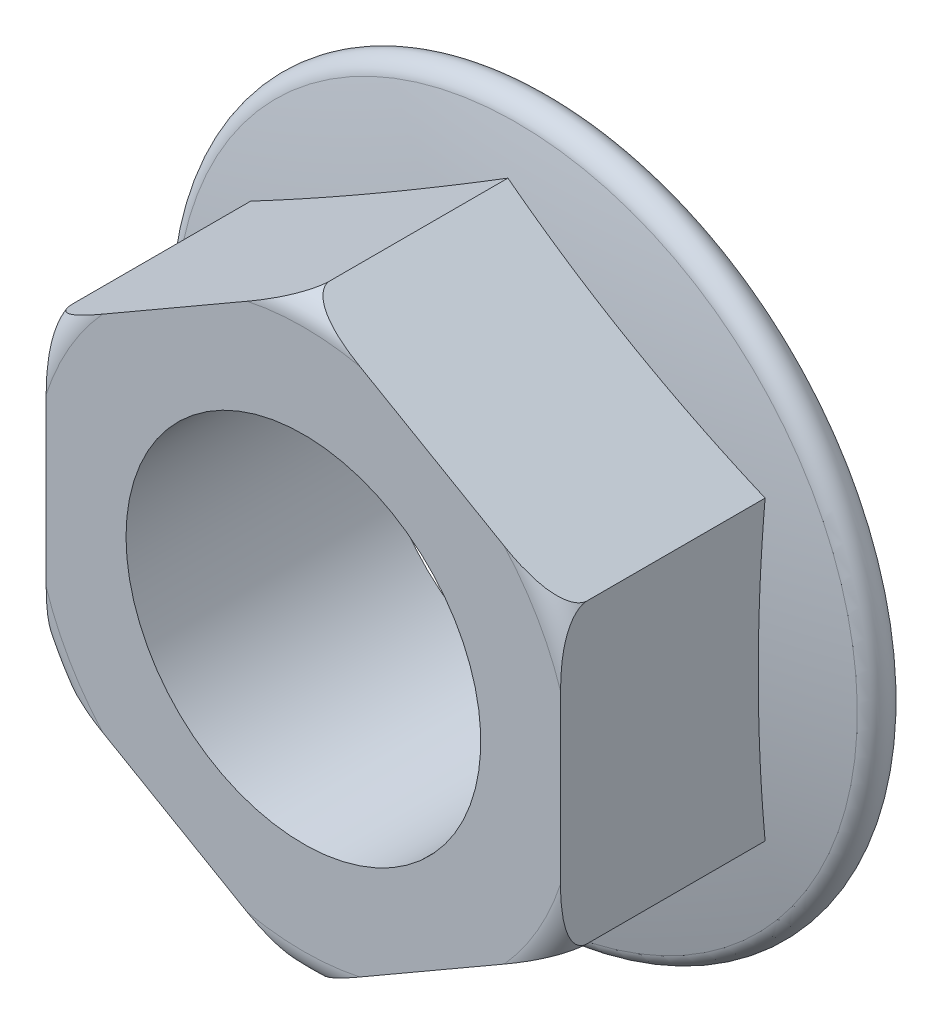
ISO-10303-21;
HEADER;
FILE_DESCRIPTION(('STEP AP214'),'2;1');
FILE_NAME('part.step','',(''),(''),'','','');
FILE_SCHEMA(('AUTOMOTIVE_DESIGN { 1 0 10303 214 1 1 1 1 }'));
ENDSEC;
DATA;
#1=APPLICATION_CONTEXT('core data for automotive mechanical design processes');
#2=APPLICATION_PROTOCOL_DEFINITION('international standard','automotive_design',2000,#1);
#3=PRODUCT_CONTEXT('',#1,'mechanical');
#4=PRODUCT('Part','Part','',(#3));
#5=PRODUCT_RELATED_PRODUCT_CATEGORY('part','',(#4));
#6=PRODUCT_DEFINITION_FORMATION('','',#4);
#7=PRODUCT_DEFINITION_CONTEXT('part definition',#1,'design');
#8=PRODUCT_DEFINITION('design','',#6,#7);
#9=PRODUCT_DEFINITION_SHAPE('','',#8);
#10=(LENGTH_UNIT() NAMED_UNIT(*) SI_UNIT(.MILLI.,.METRE.));
#11=(NAMED_UNIT(*) PLANE_ANGLE_UNIT() SI_UNIT($,.RADIAN.));
#12=(NAMED_UNIT(*) SI_UNIT($,.STERADIAN.) SOLID_ANGLE_UNIT());
#13=UNCERTAINTY_MEASURE_WITH_UNIT(LENGTH_MEASURE(1.E-05),#10,'distance_accuracy_value','');
#14=(GEOMETRIC_REPRESENTATION_CONTEXT(3) GLOBAL_UNCERTAINTY_ASSIGNED_CONTEXT((#13)) GLOBAL_UNIT_ASSIGNED_CONTEXT((#10,
#11,#12)) REPRESENTATION_CONTEXT('',''));
#15=CARTESIAN_POINT('',(0.,0.,0.));
#16=DIRECTION('',(0.,0.,1.));
#17=DIRECTION('',(1.,0.,0.));
#18=AXIS2_PLACEMENT_3D('',#15,#16,#17);
#19=CARTESIAN_POINT('',(-29.,16.7431578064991,28.));
#20=DIRECTION('',(-0.500000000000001,0.866025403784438,0.));
#21=DIRECTION('',(-0.866025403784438,-0.500000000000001,0.));
#22=AXIS2_PLACEMENT_3D('',#19,#20,#21);
#23=PLANE('',#22);
#24=DIRECTION('',(0.,0.,-1.));
#25=VECTOR('',#24,1.);
#26=CARTESIAN_POINT('',(-29.,16.7431578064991,28.));
#27=LINE('',#26,#25);
#28=CARTESIAN_POINT('',(-29.,16.7431578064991,25.));
#29=VERTEX_POINT('',#28);
#30=CARTESIAN_POINT('',(-29.,16.7431578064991,4.9357094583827));
#31=VERTEX_POINT('',#30);
#32=EDGE_CURVE('E157',#29,#31,#27,.T.);
#33=ORIENTED_EDGE('',*,*,#32,.F.);
#34=CARTESIAN_POINT('',(-28.999999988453,16.7431578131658,24.9998));
#35=CARTESIAN_POINT('',(-29.0000138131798,16.743149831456,25.0448703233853));
#36=CARTESIAN_POINT('',(-28.9982497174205,16.7441683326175,25.0899156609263));
#37=CARTESIAN_POINT('',(-28.9912582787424,16.7482048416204,25.1796102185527));
#38=CARTESIAN_POINT('',(-28.9860337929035,16.7512211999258,25.2242597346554));
#39=CARTESIAN_POINT('',(-28.9654326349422,16.7631152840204,25.3563825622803));
#40=CARTESIAN_POINT('',(-28.9451245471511,16.7748401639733,25.4428802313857));
#41=CARTESIAN_POINT('',(-28.8930581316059,16.8049007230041,25.6107147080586));
#42=CARTESIAN_POINT('',(-28.8613342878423,16.8232164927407,25.6920661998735));
#43=CARTESIAN_POINT('',(-28.7884235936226,16.8653115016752,25.849039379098));
#44=CARTESIAN_POINT('',(-28.7472155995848,16.8891029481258,25.9246477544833));
#45=CARTESIAN_POINT('',(-28.6262583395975,16.9589376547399,26.1197443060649));
#46=CARTESIAN_POINT('',(-28.5395489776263,17.0089993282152,26.2334654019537));
#47=CARTESIAN_POINT('',(-28.3520638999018,17.1172438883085,26.4442712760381));
#48=CARTESIAN_POINT('',(-28.2512447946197,17.1754518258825,26.5413025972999));
#49=CARTESIAN_POINT('',(-28.0532804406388,17.2897465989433,26.7097616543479));
#50=CARTESIAN_POINT('',(-27.9571872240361,17.3452260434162,26.7828687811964));
#51=CARTESIAN_POINT('',(-27.7598864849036,17.4591376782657,26.9193203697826));
#52=CARTESIAN_POINT('',(-27.6586749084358,17.5175722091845,26.9826569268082));
#53=CARTESIAN_POINT('',(-27.4525625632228,17.6365712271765,27.1008331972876));
#54=CARTESIAN_POINT('',(-27.3476596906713,17.6971369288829,27.1556679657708));
#55=CARTESIAN_POINT('',(-27.1352224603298,17.8197876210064,27.2578729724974));
#56=CARTESIAN_POINT('',(-27.0276888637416,17.8818721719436,27.3052453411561));
#57=CARTESIAN_POINT('',(-26.7779869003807,18.0260376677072,27.406739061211));
#58=CARTESIAN_POINT('',(-26.6351326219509,18.1085146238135,27.4586024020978));
#59=CARTESIAN_POINT('',(-26.3470918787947,18.2748150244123,27.5529404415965));
#60=CARTESIAN_POINT('',(-26.2019044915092,18.3586390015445,27.5954113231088));
#61=CARTESIAN_POINT('',(-25.909729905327,18.5273260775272,27.6723130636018));
#62=CARTESIAN_POINT('',(-25.7627403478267,18.6121905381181,27.706731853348));
#63=CARTESIAN_POINT('',(-25.4676529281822,18.7825593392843,27.7685346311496));
#64=CARTESIAN_POINT('',(-25.3195549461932,18.8680637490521,27.7959178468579));
#65=CARTESIAN_POINT('',(-25.0215320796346,19.0401273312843,27.8447263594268));
#66=CARTESIAN_POINT('',(-24.8716017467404,19.1266896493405,27.8661067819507));
#67=CARTESIAN_POINT('',(-24.5712327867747,19.3001077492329,27.9034285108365));
#68=CARTESIAN_POINT('',(-24.4207941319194,19.3869635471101,27.9193695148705));
#69=CARTESIAN_POINT('',(-24.1197601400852,19.5607656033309,27.9464750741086));
#70=CARTESIAN_POINT('',(-23.9691651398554,19.6477116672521,27.9576446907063));
#71=CARTESIAN_POINT('',(-23.6678103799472,19.8216989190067,27.9758213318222));
#72=CARTESIAN_POINT('',(-23.5170506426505,19.9087400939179,27.9828288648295));
#73=CARTESIAN_POINT('',(-23.0447885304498,20.181400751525,27.9991043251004));
#74=CARTESIAN_POINT('',(-22.7231181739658,20.3671172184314,28.0019573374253));
#75=CARTESIAN_POINT('',(-22.0798517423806,20.7385072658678,27.9956381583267));
#76=CARTESIAN_POINT('',(-21.7582556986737,20.9241808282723,27.9864633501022));
#77=CARTESIAN_POINT('',(-21.1150544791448,21.2955332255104,27.9598292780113));
#78=CARTESIAN_POINT('',(-20.793449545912,21.481211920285,27.9423627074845));
#79=CARTESIAN_POINT('',(-20.1504642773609,21.852439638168,27.9025308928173));
#80=CARTESIAN_POINT('',(-19.8290839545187,22.0379886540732,27.8801653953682));
#81=CARTESIAN_POINT('',(-19.1861599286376,22.4091810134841,27.8336489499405));
#82=CARTESIAN_POINT('',(-18.8646163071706,22.5948243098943,27.8094965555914));
#83=CARTESIAN_POINT('',(-18.2214588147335,22.9661514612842,27.7623441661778));
#84=CARTESIAN_POINT('',(-17.8998449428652,23.1518353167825,27.7393441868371));
#85=CARTESIAN_POINT('',(-17.256666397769,23.5231746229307,27.6971571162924));
#86=CARTESIAN_POINT('',(-16.9351018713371,23.7088299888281,27.6779671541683));
#87=CARTESIAN_POINT('',(-16.2917439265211,24.0802728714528,27.6455841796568));
#88=CARTESIAN_POINT('',(-15.9699505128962,24.2660603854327,27.6323910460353));
#89=CARTESIAN_POINT('',(-15.3272649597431,24.6371150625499,27.6135811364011));
#90=CARTESIAN_POINT('',(-15.0063733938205,24.822381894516,27.6079392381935));
#91=CARTESIAN_POINT('',(-14.3645593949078,25.1929333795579,27.6048204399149));
#92=CARTESIAN_POINT('',(-14.0436369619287,25.3782180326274,27.6073435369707));
#93=CARTESIAN_POINT('',(-13.4017883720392,25.748789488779,27.620256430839));
#94=CARTESIAN_POINT('',(-13.0808622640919,25.9340762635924,27.6306493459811));
#95=CARTESIAN_POINT('',(-12.4392280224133,26.3045239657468,27.6580822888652));
#96=CARTESIAN_POINT('',(-12.118519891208,26.4896848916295,27.6751223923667));
#97=CARTESIAN_POINT('',(-11.477092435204,26.860013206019,27.7139025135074));
#98=CARTESIAN_POINT('',(-11.1563732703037,27.0451805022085,27.7356459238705));
#99=CARTESIAN_POINT('',(-10.5150515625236,27.4154477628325,27.7813504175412));
#100=CARTESIAN_POINT('',(-10.1944490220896,27.6005477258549,27.8053115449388));
#101=CARTESIAN_POINT('',(-9.55327457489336,27.9707299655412,27.85264559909));
#102=CARTESIAN_POINT('',(-9.23270267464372,28.1558122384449,27.8760186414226));
#103=CARTESIAN_POINT('',(-8.59138102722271,28.5260794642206,27.9191574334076));
#104=CARTESIAN_POINT('',(-8.27063128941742,28.711264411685,27.9389233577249));
#105=CARTESIAN_POINT('',(-7.73376299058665,29.0212254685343,27.9662488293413));
#106=CARTESIAN_POINT('',(-7.51771836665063,29.1459588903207,27.975686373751));
#107=CARTESIAN_POINT('',(-7.08555125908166,29.3954706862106,27.9903736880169));
#108=CARTESIAN_POINT('',(-6.86942879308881,29.5202490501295,27.9956241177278));
#109=CARTESIAN_POINT('',(-6.43669346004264,29.7700889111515,28.0007856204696));
#110=CARTESIAN_POINT('',(-6.22008048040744,29.8951504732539,28.0006859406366));
#111=CARTESIAN_POINT('',(-5.78691897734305,30.1452363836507,27.9938255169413));
#112=CARTESIAN_POINT('',(-5.57037045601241,30.2702607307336,27.9870645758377));
#113=CARTESIAN_POINT('',(-5.11034633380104,30.535855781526,27.9640544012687));
#114=CARTESIAN_POINT('',(-4.866908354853,30.6764047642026,27.9467190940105));
#115=CARTESIAN_POINT('',(-4.38098605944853,30.9569521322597,27.8992780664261));
#116=CARTESIAN_POINT('',(-4.13850157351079,31.0969506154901,27.8691747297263));
#117=CARTESIAN_POINT('',(-3.655895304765,31.3755834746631,27.793219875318));
#118=CARTESIAN_POINT('',(-3.41576922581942,31.5142203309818,27.7474066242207));
#119=CARTESIAN_POINT('',(-3.05825677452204,31.720630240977,27.663900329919));
#120=CARTESIAN_POINT('',(-2.93956723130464,31.7891556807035,27.6336117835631));
#121=CARTESIAN_POINT('',(-2.70336233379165,31.9255286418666,27.5674677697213));
#122=CARTESIAN_POINT('',(-2.58584688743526,31.9933762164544,27.5316127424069));
#123=CARTESIAN_POINT('',(-2.30460011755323,32.1557541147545,27.4376528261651));
#124=CARTESIAN_POINT('',(-2.14162608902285,32.2498472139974,27.3764458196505));
#125=CARTESIAN_POINT('',(-1.8202700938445,32.4353821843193,27.2389479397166));
#126=CARTESIAN_POINT('',(-1.66189318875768,32.5268211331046,27.1626411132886));
#127=CARTESIAN_POINT('',(-1.35135804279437,32.7061086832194,26.9909536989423));
#128=CARTESIAN_POINT('',(-1.19925496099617,32.7939254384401,26.8954351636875));
#129=CARTESIAN_POINT('',(-0.980717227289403,32.9200982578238,26.7349938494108));
#130=CARTESIAN_POINT('',(-0.909522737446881,32.9612024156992,26.6787002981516));
#131=CARTESIAN_POINT('',(-0.771273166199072,33.0410208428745,26.5597408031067));
#132=CARTESIAN_POINT('',(-0.704215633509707,33.0797365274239,26.4970786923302));
#133=CARTESIAN_POINT('',(-0.567306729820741,33.1587809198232,26.3563174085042));
#134=CARTESIAN_POINT('',(-0.498175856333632,33.1986936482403,26.2772682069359));
#135=CARTESIAN_POINT('',(-0.369214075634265,33.2731497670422,26.1094435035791));
#136=CARTESIAN_POINT('',(-0.309387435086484,33.3076906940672,26.0206635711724));
#137=CARTESIAN_POINT('',(-0.201745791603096,33.3698376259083,25.8318463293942));
#138=CARTESIAN_POINT('',(-0.154100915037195,33.3973454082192,25.7316751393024));
#139=CARTESIAN_POINT('',(-0.0957732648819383,33.4310208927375,25.5751409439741));
#140=CARTESIAN_POINT('',(-0.0785329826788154,33.4409745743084,25.5219814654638));
#141=CARTESIAN_POINT('',(-0.0488800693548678,33.4580946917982,25.413910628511));
#142=CARTESIAN_POINT('',(-0.0364639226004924,33.4652631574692,25.3590005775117));
#143=CARTESIAN_POINT('',(-0.0178761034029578,33.4759948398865,25.2535876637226));
#144=CARTESIAN_POINT('',(-0.0111982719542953,33.479850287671,25.2032036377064));
#145=CARTESIAN_POINT('',(-0.00224182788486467,33.4850212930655,25.1018200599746));
#146=CARTESIAN_POINT('',(2.81828445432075E-05,33.4863318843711,25.0508194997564));
#147=CARTESIAN_POINT('',(-1.15470001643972E-08,33.4863156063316,24.9998));
#148=B_SPLINE_CURVE_WITH_KNOTS('',3,(#34,#35,#36,#37,#38,#39,#40,#41,#42,#43,#44,#45,#46,#47,
#48,#49,#50,#51,#52,#53,#54,#55,#56,#57,#58,#59,#60,#61,#62,#63,#64,#65,#66,#67,#68,#69,#70,#71,
#72,#73,#74,#75,#76,#77,#78,#79,#80,#81,#82,#83,#84,#85,#86,#87,#88,#89,#90,#91,#92,#93,#94,#95,
#96,#97,#98,#99,#100,#101,#102,#103,#104,#105,#106,#107,#108,#109,#110,#111,#112,#113,#114,#115,
#116,#117,#118,#119,#120,#121,#122,#123,#124,#125,#126,#127,#128,#129,#130,#131,#132,#133,#134,
#135,#136,#137,#138,#139,#140,#141,#142,#143,#144,#145,#146,#147),.UNSPECIFIED.,.F.,.F.,(4,2,2,
2,2,2,2,2,2,2,2,2,2,2,2,2,2,2,2,2,2,2,2,2,2,2,2,2,2,2,2,2,2,2,2,2,2,2,2,2,2,2,2,2,2,2,2,2,2,2,2,
2,2,2,2,2,4),(0.,0.135117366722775,0.270123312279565,0.537620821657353,0.804316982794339,
1.07161356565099,1.52355235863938,1.97691278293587,2.37497079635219,2.7733491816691,
3.17195841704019,3.57045364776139,4.08884962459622,4.60745589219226,5.1268345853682,
5.64627027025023,6.16949148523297,6.69274177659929,7.21543562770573,7.73806560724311,
8.85208449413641,9.96634578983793,11.0815907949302,12.1968934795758,13.3131090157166,
14.4293397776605,15.5447262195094,16.6600901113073,17.771733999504,18.8833774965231,
19.9954617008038,21.1075585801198,22.2204603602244,23.3333842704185,24.4460877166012,
25.5587372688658,26.3076469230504,27.0564385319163,27.8067351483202,28.5570539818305,
29.401709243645,30.2462068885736,31.0886619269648,31.5096372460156,31.9305792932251,
32.5236991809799,33.117449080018,33.7156251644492,34.0142762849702,34.3127487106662,
34.6489957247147,34.9853964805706,35.3262661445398,35.4963097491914,35.6662291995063,
35.8188900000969,35.971848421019),.UNSPECIFIED.);
#149=CARTESIAN_POINT('',(-22.6431922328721,20.4132624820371,28.));
#150=VERTEX_POINT('',#149);
#151=EDGE_CURVE('E289',#29,#150,#148,.T.);
#152=ORIENTED_EDGE('',*,*,#151,.T.);
#153=DIRECTION('',(0.866025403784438,0.500000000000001,0.));
#154=VECTOR('',#153,1.);
#155=CARTESIAN_POINT('',(-29.,16.7431578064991,28.));
#156=LINE('',#155,#154);
#157=CARTESIAN_POINT('',(-6.35680776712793,29.8162109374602,28.));
#158=VERTEX_POINT('',#157);
#159=EDGE_CURVE('E200',#150,#158,#156,.T.);
#160=ORIENTED_EDGE('',*,*,#159,.T.);
#161=CARTESIAN_POINT('',(0.,33.4863156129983,25.));
#162=VERTEX_POINT('',#161);
#163=EDGE_CURVE('E231',#158,#162,#148,.T.);
#164=ORIENTED_EDGE('',*,*,#163,.T.);
#165=DIRECTION('',(0.,0.,-1.));
#166=VECTOR('',#165,1.);
#167=CARTESIAN_POINT('',(0.,33.4863156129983,28.));
#168=LINE('',#167,#166);
#169=CARTESIAN_POINT('',(0.,33.4863156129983,4.9357094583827));
#170=VERTEX_POINT('',#169);
#171=EDGE_CURVE('E149',#162,#170,#168,.T.);
#172=ORIENTED_EDGE('',*,*,#171,.T.);
#173=CARTESIAN_POINT('',(-14.5,25.1147367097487,-176.5));
#174=DIRECTION('',(-0.500000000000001,0.866025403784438,0.));
#175=DIRECTION('',(-0.866025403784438,-0.500000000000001,0.));
#176=AXIS2_PLACEMENT_3D('',#173,#174,#175);
#177=CIRCLE('',#176,182.206613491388);
#178=EDGE_CURVE('E194',#170,#31,#177,.F.);
#179=ORIENTED_EDGE('',*,*,#178,.T.);
#180=EDGE_LOOP('',(#33,#152,#160,#164,#172,#179));
#181=FACE_BOUND('',#180,.T.);
#182=ADVANCED_FACE('F36',(#181),#23,.T.);
#183=CARTESIAN_POINT('',(-29.,-16.743157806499,28.));
#184=DIRECTION('',(-1.,0.,0.));
#185=DIRECTION('',(0.,-1.,0.));
#186=AXIS2_PLACEMENT_3D('',#183,#184,#185);
#187=PLANE('',#186);
#188=DIRECTION('',(0.,1.,0.));
#189=VECTOR('',#188,1.);
#190=CARTESIAN_POINT('',(-29.,-16.743157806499,28.));
#191=LINE('',#190,#189);
#192=CARTESIAN_POINT('',(-29.,-9.40294845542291,28.));
#193=VERTEX_POINT('',#192);
#194=CARTESIAN_POINT('',(-29.,9.40294845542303,28.));
#195=VERTEX_POINT('',#194);
#196=EDGE_CURVE('E153',#193,#195,#191,.T.);
#197=ORIENTED_EDGE('',*,*,#196,.T.);
#198=CARTESIAN_POINT('',(-29.,0.,27.6059289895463));
#199=CARTESIAN_POINT('',(-29.,0.249997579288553,27.6059291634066));
#200=CARTESIAN_POINT('',(-29.,0.499995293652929,27.6077813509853));
#201=CARTESIAN_POINT('',(-29.,0.999937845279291,27.6150890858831));
#202=CARTESIAN_POINT('',(-29.,1.24988268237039,27.6205446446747));
#203=CARTESIAN_POINT('',(-29.,1.74980508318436,27.6347689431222));
#204=CARTESIAN_POINT('',(-29.,1.99978259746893,27.6435393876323));
#205=CARTESIAN_POINT('',(-29.,2.499620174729,27.6639198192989));
#206=CARTESIAN_POINT('',(-29.,2.74948023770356,27.6755298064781));
#207=CARTESIAN_POINT('',(-29.,3.49971615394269,27.7137737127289));
#208=CARTESIAN_POINT('',(-29.,3.99991428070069,27.7437941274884));
#209=CARTESIAN_POINT('',(-29.,5.00002875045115,27.8067335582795));
#210=CARTESIAN_POINT('',(-29.,5.49994512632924,27.8396520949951));
#211=CARTESIAN_POINT('',(-29.,6.45832868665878,27.8986467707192));
#212=CARTESIAN_POINT('',(-29.,6.91677372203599,27.9250646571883));
#213=CARTESIAN_POINT('',(-29.,7.83428978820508,27.9682914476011));
#214=CARTESIAN_POINT('',(-29.,8.29336094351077,27.985098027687));
#215=CARTESIAN_POINT('',(-29.,8.9820770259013,27.998003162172));
#216=CARTESIAN_POINT('',(-29.,9.21160030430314,28.0002552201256));
#217=CARTESIAN_POINT('',(-29.,9.67063588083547,27.9996984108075));
#218=CARTESIAN_POINT('',(-29.,9.90014817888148,27.9968898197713));
#219=CARTESIAN_POINT('',(-29.,10.3589252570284,27.9851606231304));
#220=CARTESIAN_POINT('',(-29.,10.5881901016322,27.9762427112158));
#221=CARTESIAN_POINT('',(-29.,11.0463072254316,27.9510973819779));
#222=CARTESIAN_POINT('',(-29.,11.2751595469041,27.9348707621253));
#223=CARTESIAN_POINT('',(-29.,11.7335875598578,27.8935758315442));
#224=CARTESIAN_POINT('',(-29.,11.9631582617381,27.8684506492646));
#225=CARTESIAN_POINT('',(-29.,12.4209875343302,27.8076629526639));
#226=CARTESIAN_POINT('',(-29.,12.6492457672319,27.7719978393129));
#227=CARTESIAN_POINT('',(-29.,13.1029771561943,27.6881107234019));
#228=CARTESIAN_POINT('',(-29.,13.3284553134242,27.6399163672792));
#229=CARTESIAN_POINT('',(-29.,13.7755247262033,27.5282973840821));
#230=CARTESIAN_POINT('',(-29.,13.9971183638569,27.4648824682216));
#231=CARTESIAN_POINT('',(-29.,14.4218033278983,27.3234095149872));
#232=CARTESIAN_POINT('',(-29.,14.625230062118,27.2463897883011));
#233=CARTESIAN_POINT('',(-29.,14.9236821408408,27.1153231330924));
#234=CARTESIAN_POINT('',(-29.,15.0221104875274,27.0690111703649));
#235=CARTESIAN_POINT('',(-29.,15.216002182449,26.9705696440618));
#236=CARTESIAN_POINT('',(-29.,15.3114660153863,26.9184410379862));
#237=CARTESIAN_POINT('',(-29.,15.5601100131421,26.771245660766));
#238=CARTESIAN_POINT('',(-29.,15.709999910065,26.670470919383));
#239=CARTESIAN_POINT('',(-29.,15.9928358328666,26.4473752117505));
#240=CARTESIAN_POINT('',(-29.,16.1258307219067,26.3251189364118));
#241=CARTESIAN_POINT('',(-29.,16.3155704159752,26.1106007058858));
#242=CARTESIAN_POINT('',(-29.,16.3813295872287,26.0263586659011));
#243=CARTESIAN_POINT('',(-29.,16.4996420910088,25.8489982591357));
#244=CARTESIAN_POINT('',(-29.,16.5522117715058,25.7558910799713));
#245=CARTESIAN_POINT('',(-29.,16.6334238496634,25.5766926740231));
#246=CARTESIAN_POINT('',(-29.,16.6644996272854,25.491716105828));
#247=CARTESIAN_POINT('',(-29.,16.7119761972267,25.3177396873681));
#248=CARTESIAN_POINT('',(-29.,16.7283887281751,25.2287431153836));
#249=CARTESIAN_POINT('',(-29.,16.7450733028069,25.0488702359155));
#250=CARTESIAN_POINT('',(-29.,16.7452827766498,24.9579879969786));
#251=CARTESIAN_POINT('',(-29.,16.7293790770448,24.7776647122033));
#252=CARTESIAN_POINT('',(-29.,16.7132607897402,24.6882241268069));
#253=CARTESIAN_POINT('',(-29.,16.6675260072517,24.518259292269));
#254=CARTESIAN_POINT('',(-29.,16.6387059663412,24.4375155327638));
#255=CARTESIAN_POINT('',(-29.,16.5698570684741,24.2810186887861));
#256=CARTESIAN_POINT('',(-29.,16.5298244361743,24.2052672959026));
#257=CARTESIAN_POINT('',(-29.,16.4142545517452,24.0162364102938));
#258=CARTESIAN_POINT('',(-29.,16.3317184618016,23.9072440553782));
#259=CARTESIAN_POINT('',(-29.,16.1506703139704,23.7033959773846));
#260=CARTESIAN_POINT('',(-29.,16.0521113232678,23.6085834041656));
#261=CARTESIAN_POINT('',(-29.,15.8605844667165,23.4458330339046));
#262=CARTESIAN_POINT('',(-29.,15.769183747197,23.3760147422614));
#263=CARTESIAN_POINT('',(-29.,15.5806620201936,23.2445044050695));
#264=CARTESIAN_POINT('',(-29.,15.4835368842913,23.1828183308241));
#265=CARTESIAN_POINT('',(-29.,15.2849615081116,23.0666138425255));
#266=CARTESIAN_POINT('',(-29.,15.1835058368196,23.0121048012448));
#267=CARTESIAN_POINT('',(-29.,14.9773813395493,22.9094898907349));
#268=CARTESIAN_POINT('',(-29.,14.87271127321,22.8613865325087));
#269=CARTESIAN_POINT('',(-29.,14.6593913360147,22.7702187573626));
#270=CARTESIAN_POINT('',(-29.,14.5507055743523,22.7272388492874));
#271=CARTESIAN_POINT('',(-29.,14.3314002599,22.6465060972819));
#272=CARTESIAN_POINT('',(-29.,14.2207803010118,22.6087543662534));
#273=CARTESIAN_POINT('',(-29.,13.8865189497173,22.5024446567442));
#274=CARTESIAN_POINT('',(-29.,13.6606372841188,22.4408987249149));
#275=CARTESIAN_POINT('',(-29.,13.2049175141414,22.3328786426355));
#276=CARTESIAN_POINT('',(-29.,12.9750722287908,22.2864357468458));
#277=CARTESIAN_POINT('',(-29.,12.6288052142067,22.2262196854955));
#278=CARTESIAN_POINT('',(-29.,12.5131775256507,22.2077276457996));
#279=CARTESIAN_POINT('',(-29.,12.2815022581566,22.1736109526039));
#280=CARTESIAN_POINT('',(-29.,12.1654546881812,22.1579862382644));
#281=CARTESIAN_POINT('',(-29.,11.8040733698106,22.1134553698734));
#282=CARTESIAN_POINT('',(-29.,11.558179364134,22.0890522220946));
#283=CARTESIAN_POINT('',(-29.,11.0656089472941,22.0498537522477));
#284=CARTESIAN_POINT('',(-29.,10.8189323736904,22.0350605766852));
#285=CARTESIAN_POINT('',(-29.,10.3250580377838,22.0134232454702));
#286=CARTESIAN_POINT('',(-29.,10.0778600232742,22.0065850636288));
#287=CARTESIAN_POINT('',(-29.,9.58336193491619,21.999457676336));
#288=CARTESIAN_POINT('',(-29.,9.33606185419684,21.9991690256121));
#289=CARTESIAN_POINT('',(-29.,8.59232708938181,22.0062345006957));
#290=CARTESIAN_POINT('',(-29.,8.09597812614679,22.0215838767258));
#291=CARTESIAN_POINT('',(-29.,7.10409950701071,22.0647128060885));
#292=CARTESIAN_POINT('',(-29.,6.60856961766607,22.0924878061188));
#293=CARTESIAN_POINT('',(-29.,5.61622251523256,22.1528832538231));
#294=CARTESIAN_POINT('',(-29.,5.11940628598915,22.1855189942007));
#295=CARTESIAN_POINT('',(-29.,4.12557711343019,22.248476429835));
#296=CARTESIAN_POINT('',(-29.,3.62856415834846,22.2787979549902));
#297=CARTESIAN_POINT('',(-29.,2.88350696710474,22.3179173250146));
#298=CARTESIAN_POINT('',(-29.,2.63563406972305,22.3298823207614));
#299=CARTESIAN_POINT('',(-29.,2.13977426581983,22.3511181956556));
#300=CARTESIAN_POINT('',(-29.,1.89178736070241,22.360389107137));
#301=CARTESIAN_POINT('',(-29.,1.39573250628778,22.3757457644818));
#302=CARTESIAN_POINT('',(-29.,1.14766456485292,22.3818317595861));
#303=CARTESIAN_POINT('',(-29.,0.651466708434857,22.3904973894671));
#304=CARTESIAN_POINT('',(-29.,0.403336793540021,22.3930770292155));
#305=CARTESIAN_POINT('',(-29.,-0.0901937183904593,22.3945829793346));
#306=CARTESIAN_POINT('',(-29.,-0.33559419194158,22.3935493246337));
#307=CARTESIAN_POINT('',(-29.,-0.826354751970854,22.3879721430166));
#308=CARTESIAN_POINT('',(-29.,-1.07171483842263,22.3834286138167));
#309=CARTESIAN_POINT('',(-29.,-1.56236735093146,22.3710671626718));
#310=CARTESIAN_POINT('',(-29.,-1.8076597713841,22.3632490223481));
#311=CARTESIAN_POINT('',(-29.,-2.29813785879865,22.3447469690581));
#312=CARTESIAN_POINT('',(-29.,-2.54332352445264,22.3340630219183));
#313=CARTESIAN_POINT('',(-29.,-3.28014569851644,22.2984285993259));
#314=CARTESIAN_POINT('',(-29.,-3.7716066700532,22.2699376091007));
#315=CARTESIAN_POINT('',(-29.,-4.75424958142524,22.2091385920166));
#316=CARTESIAN_POINT('',(-29.,-5.24543153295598,22.1768307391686));
#317=CARTESIAN_POINT('',(-29.,-6.22732013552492,22.1151194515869));
#318=CARTESIAN_POINT('',(-29.,-6.71802653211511,22.0857121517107));
#319=CARTESIAN_POINT('',(-29.,-7.70015387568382,22.0370260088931));
#320=CARTESIAN_POINT('',(-29.,-8.19157498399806,22.0177499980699));
#321=CARTESIAN_POINT('',(-29.,-8.92821435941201,22.0026318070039));
#322=CARTESIAN_POINT('',(-29.,-9.17328170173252,21.999885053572));
#323=CARTESIAN_POINT('',(-29.,-9.66340753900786,22.0001224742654));
#324=CARTESIAN_POINT('',(-29.,-9.90846603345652,22.0031062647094));
#325=CARTESIAN_POINT('',(-29.,-10.3982637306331,22.0160836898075));
#326=CARTESIAN_POINT('',(-29.,-10.6430030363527,22.0260732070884));
#327=CARTESIAN_POINT('',(-29.,-11.131974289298,22.0545293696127));
#328=CARTESIAN_POINT('',(-29.,-11.3762063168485,22.072994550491));
#329=CARTESIAN_POINT('',(-29.,-11.7434026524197,22.1085142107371));
#330=CARTESIAN_POINT('',(-29.,-11.8667377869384,22.1217686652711));
#331=CARTESIAN_POINT('',(-29.,-12.113065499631,22.1511698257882));
#332=CARTESIAN_POINT('',(-29.,-12.2360580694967,22.1673166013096));
#333=CARTESIAN_POINT('',(-29.,-12.6045524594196,22.2205488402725));
#334=CARTESIAN_POINT('',(-29.,-12.8493903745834,22.2624095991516));
#335=CARTESIAN_POINT('',(-29.,-13.3348956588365,22.3614141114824));
#336=CARTESIAN_POINT('',(-29.,-13.5755769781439,22.418487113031));
#337=CARTESIAN_POINT('',(-29.,-13.9325008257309,22.5183193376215));
#338=CARTESIAN_POINT('',(-29.,-14.0507449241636,22.5539497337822));
#339=CARTESIAN_POINT('',(-29.,-14.2854864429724,22.6305382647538));
#340=CARTESIAN_POINT('',(-29.,-14.4019840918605,22.6714956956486));
#341=CARTESIAN_POINT('',(-29.,-14.6747541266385,22.7754146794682));
#342=CARTESIAN_POINT('',(-29.,-14.8300611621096,22.840957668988));
#343=CARTESIAN_POINT('',(-29.,-15.1347119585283,22.985367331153));
#344=CARTESIAN_POINT('',(-29.,-15.2840474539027,23.0642517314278));
#345=CARTESIAN_POINT('',(-29.,-15.5744814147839,23.2385415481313));
#346=CARTESIAN_POINT('',(-29.,-15.7155071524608,23.3340701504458));
#347=CARTESIAN_POINT('',(-29.,-15.9825330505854,23.5443053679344));
#348=CARTESIAN_POINT('',(-29.,-16.1085679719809,23.6589660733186));
#349=CARTESIAN_POINT('',(-29.,-16.293851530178,23.8631246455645));
#350=CARTESIAN_POINT('',(-29.,-16.3604217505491,23.9459352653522));
#351=CARTESIAN_POINT('',(-29.,-16.4809628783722,24.1204092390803));
#352=CARTESIAN_POINT('',(-29.,-16.5349375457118,24.2120699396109));
#353=CARTESIAN_POINT('',(-29.,-16.6269461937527,24.4046802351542));
#354=CARTESIAN_POINT('',(-29.,-16.664770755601,24.5057323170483));
#355=CARTESIAN_POINT('',(-29.,-16.7193577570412,24.7133604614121));
#356=CARTESIAN_POINT('',(-29.,-16.7361589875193,24.8199259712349));
#357=CARTESIAN_POINT('',(-29.,-16.7458428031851,25.0184812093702));
#358=CARTESIAN_POINT('',(-29.,-16.7418603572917,25.1103265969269));
#359=CARTESIAN_POINT('',(-29.,-16.7174644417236,25.2918101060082));
#360=CARTESIAN_POINT('',(-29.,-16.6970448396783,25.3814473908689));
#361=CARTESIAN_POINT('',(-29.,-16.6432503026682,25.550968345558));
#362=CARTESIAN_POINT('',(-29.,-16.6106888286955,25.6311164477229));
#363=CARTESIAN_POINT('',(-29.,-16.5347877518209,25.7860594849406));
#364=CARTESIAN_POINT('',(-29.,-16.491445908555,25.8608533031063));
#365=CARTESIAN_POINT('',(-29.,-16.3646348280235,26.0520652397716));
#366=CARTESIAN_POINT('',(-29.,-16.2735469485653,26.1634229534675));
#367=CARTESIAN_POINT('',(-29.,-16.0752419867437,26.37079164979));
#368=CARTESIAN_POINT('',(-29.,-15.9679737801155,26.4667519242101));
#369=CARTESIAN_POINT('',(-29.,-15.7585039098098,26.6324059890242));
#370=CARTESIAN_POINT('',(-29.,-15.6576962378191,26.7038962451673));
#371=CARTESIAN_POINT('',(-29.,-15.450264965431,26.8379630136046));
#372=CARTESIAN_POINT('',(-29.,-15.3436369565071,26.9005326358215));
#373=CARTESIAN_POINT('',(-29.,-15.1260544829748,27.0178761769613));
#374=CARTESIAN_POINT('',(-29.,-15.0150950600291,27.0726408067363));
#375=CARTESIAN_POINT('',(-29.,-14.790002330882,27.1752673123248));
#376=CARTESIAN_POINT('',(-29.,-14.6758677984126,27.2231264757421));
#377=CARTESIAN_POINT('',(-29.,-14.4408829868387,27.3144262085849));
#378=CARTESIAN_POINT('',(-29.,-14.3199418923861,27.3576315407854));
#379=CARTESIAN_POINT('',(-29.,-14.0761272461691,27.4382285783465));
#380=CARTESIAN_POINT('',(-29.,-13.9532532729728,27.4756189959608));
#381=CARTESIAN_POINT('',(-29.,-13.5822534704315,27.5801147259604));
#382=CARTESIAN_POINT('',(-29.,-13.3319363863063,27.639474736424));
#383=CARTESIAN_POINT('',(-29.,-12.8274614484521,27.7417617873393));
#384=CARTESIAN_POINT('',(-29.,-12.5732958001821,27.7846489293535));
#385=CARTESIAN_POINT('',(-29.,-12.1907563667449,27.8387989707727));
#386=CARTESIAN_POINT('',(-29.,-12.0630743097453,27.8551481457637));
#387=CARTESIAN_POINT('',(-29.,-11.8073561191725,27.8847759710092));
#388=CARTESIAN_POINT('',(-29.,-11.6793199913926,27.8980546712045));
#389=CARTESIAN_POINT('',(-29.,-11.3118599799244,27.9321463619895));
#390=CARTESIAN_POINT('',(-29.,-11.0721137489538,27.9495090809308));
#391=CARTESIAN_POINT('',(-29.,-10.5921604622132,27.9761862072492));
#392=CARTESIAN_POINT('',(-29.,-10.3519533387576,27.9854993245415));
#393=CARTESIAN_POINT('',(-29.,-9.8712533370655,27.997455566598));
#394=CARTESIAN_POINT('',(-29.,-9.6307603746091,28.000095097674));
#395=CARTESIAN_POINT('',(-29.,-9.14977108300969,27.9998998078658));
#396=CARTESIAN_POINT('',(-29.,-8.90927475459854,27.9970646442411));
#397=CARTESIAN_POINT('',(-29.,-8.18666788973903,27.9819700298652));
#398=CARTESIAN_POINT('',(-29.,-7.70470367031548,27.9631018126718));
#399=CARTESIAN_POINT('',(-29.,-6.74126107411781,27.9155342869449));
#400=CARTESIAN_POINT('',(-29.,-6.25978277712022,27.8868335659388));
#401=CARTESIAN_POINT('',(-29.,-5.29683045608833,27.8264797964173));
#402=CARTESIAN_POINT('',(-29.,-4.81535650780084,27.7948255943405));
#403=CARTESIAN_POINT('',(-29.,-3.85216139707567,27.7348904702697));
#404=CARTESIAN_POINT('',(-29.,-3.37044022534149,27.7066096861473));
#405=CARTESIAN_POINT('',(-29.,-2.64796678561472,27.6707555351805));
#406=CARTESIAN_POINT('',(-29.,-2.40738116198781,27.6599056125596));
#407=CARTESIAN_POINT('',(-29.,-1.92610502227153,27.6408924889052));
#408=CARTESIAN_POINT('',(-29.,-1.68541450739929,27.6327292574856));
#409=CARTESIAN_POINT('',(-29.,-1.2039596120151,27.6194992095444));
#410=CARTESIAN_POINT('',(-29.,-0.963195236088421,27.6144322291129));
#411=CARTESIAN_POINT('',(-29.,-0.48162061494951,27.6076470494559));
#412=CARTESIAN_POINT('',(-29.,-0.240810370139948,27.6059288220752));
#413=CARTESIAN_POINT('',(-29.,0.,27.6059289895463));
#414=B_SPLINE_CURVE_WITH_KNOTS('',3,(#198,#199,#200,#201,#202,#203,#204,#205,#206,#207,#208,
#209,#210,#211,#212,#213,#214,#215,#216,#217,#218,#219,#220,#221,#222,#223,#224,#225,#226,#227,
#228,#229,#230,#231,#232,#233,#234,#235,#236,#237,#238,#239,#240,#241,#242,#243,#244,#245,#246,
#247,#248,#249,#250,#251,#252,#253,#254,#255,#256,#257,#258,#259,#260,#261,#262,#263,#264,#265,
#266,#267,#268,#269,#270,#271,#272,#273,#274,#275,#276,#277,#278,#279,#280,#281,#282,#283,#284,
#285,#286,#287,#288,#289,#290,#291,#292,#293,#294,#295,#296,#297,#298,#299,#300,#301,#302,#303,
#304,#305,#306,#307,#308,#309,#310,#311,#312,#313,#314,#315,#316,#317,#318,#319,#320,#321,#322,
#323,#324,#325,#326,#327,#328,#329,#330,#331,#332,#333,#334,#335,#336,#337,#338,#339,#340,#341,
#342,#343,#344,#345,#346,#347,#348,#349,#350,#351,#352,#353,#354,#355,#356,#357,#358,#359,#360,
#361,#362,#363,#364,#365,#366,#367,#368,#369,#370,#371,#372,#373,#374,#375,#376,#377,#378,#379,
#380,#381,#382,#383,#384,#385,#386,#387,#388,#389,#390,#391,#392,#393,#394,#395,#396,#397,#398,
#399,#400,#401,#402,#403,#404,#405,#406,#407,#408,#409,#410,#411,#412,#413),.UNSPECIFIED.,.T.,
.F.,(4,2,2,2,2,2,2,2,2,2,2,2,2,2,2,2,2,2,2,2,2,2,2,2,2,2,2,2,2,2,2,2,2,2,2,2,2,2,2,2,2,2,2,2,2,
2,2,2,2,2,2,2,2,2,2,2,2,2,2,2,2,2,2,2,2,2,2,2,2,2,2,2,2,2,2,2,2,2,2,2,2,2,2,2,2,2,2,2,2,2,2,2,2,
2,2,2,2,2,2,2,2,2,2,2,2,2,2,4),(0.,0.749986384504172,1.49997515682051,2.25035017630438,
3.00072520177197,4.5039764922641,6.00697962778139,7.38456734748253,8.7624880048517,
9.45104670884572,10.1395678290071,10.8277855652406,11.5159282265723,12.2085506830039,
12.901344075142,13.5926215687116,14.2834591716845,14.9349942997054,15.2611668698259,
15.5872858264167,16.1276795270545,16.6664729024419,16.986163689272,17.3054562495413,
17.575770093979,17.845867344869,18.117007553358,18.3882327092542,18.6444464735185,
18.900746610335,19.3085581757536,19.7175865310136,20.06214683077,20.4069587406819,
20.7522165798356,21.0976093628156,21.448081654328,21.7986284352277,22.5002433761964,
23.2033011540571,23.5545615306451,23.9058144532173,24.6468628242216,25.3880766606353,
26.1298467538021,26.8716796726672,28.3611037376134,29.8499824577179,31.3436484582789,
32.837424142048,33.5818961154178,34.3263591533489,35.0707639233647,35.8151676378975,
36.551349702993,37.2875322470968,38.0237638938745,38.7600043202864,40.2368082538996,
41.7135448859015,43.1882863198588,44.6634397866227,45.3986355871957,46.1337821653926,
46.8684970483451,47.6030850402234,47.9751908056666,48.3473055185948,49.0920783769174,
49.8334459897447,50.2038271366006,50.574159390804,51.0793573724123,51.5852319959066,
52.0950233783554,52.6036085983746,52.9214814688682,53.2392593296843,53.5610411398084,
53.8822283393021,54.1565056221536,54.4308852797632,54.689469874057,54.9481082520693,
55.377231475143,55.8077401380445,56.1779629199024,56.5484701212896,56.9194146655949,
57.2905045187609,57.675613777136,58.060808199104,58.8317927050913,59.6046329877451,
59.9907749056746,60.3769105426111,61.0978519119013,61.81890880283,62.5403538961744,
63.261844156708,64.7086149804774,66.155593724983,67.60314001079,69.0507454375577,69.77322292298,
70.4956922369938,71.2181233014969,71.9405482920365),.UNSPECIFIED.);
#415=EDGE_CURVE('E214',#195,#29,#414,.T.);
#416=ORIENTED_EDGE('',*,*,#415,.T.);
#417=ORIENTED_EDGE('',*,*,#32,.T.);
#418=CARTESIAN_POINT('',(-29.,0.,-176.5));
#419=DIRECTION('',(-1.,0.,0.));
#420=DIRECTION('',(0.,-1.,0.));
#421=AXIS2_PLACEMENT_3D('',#418,#419,#420);
#422=CIRCLE('',#421,182.206613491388);
#423=CARTESIAN_POINT('',(-29.,-16.743157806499,4.9357094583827));
#424=VERTEX_POINT('',#423);
#425=EDGE_CURVE('E192',#31,#424,#422,.F.);
#426=ORIENTED_EDGE('',*,*,#425,.T.);
#427=DIRECTION('',(0.,0.,-1.));
#428=VECTOR('',#427,1.);
#429=CARTESIAN_POINT('',(-29.,-16.743157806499,28.));
#430=LINE('',#429,#428);
#431=CARTESIAN_POINT('',(-29.,-16.743157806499,25.));
#432=VERTEX_POINT('',#431);
#433=EDGE_CURVE('E159',#432,#424,#430,.T.);
#434=ORIENTED_EDGE('',*,*,#433,.F.);
#435=EDGE_CURVE('E215',#432,#193,#414,.T.);
#436=ORIENTED_EDGE('',*,*,#435,.T.);
#437=EDGE_LOOP('',(#197,#416,#417,#426,#434,#436));
#438=FACE_BOUND('',#437,.T.);
#439=ADVANCED_FACE('F213',(#438),#187,.T.);
#440=CARTESIAN_POINT('',(-1.35110370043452E-13,-33.4863156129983,28.));
#441=DIRECTION('',(-0.500000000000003,-0.866025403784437,0.));
#442=DIRECTION('',(0.866025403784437,-0.500000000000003,0.));
#443=AXIS2_PLACEMENT_3D('',#440,#441,#442);
#444=PLANE('',#443);
#445=DIRECTION('',(0.,0.,-1.));
#446=VECTOR('',#445,1.);
#447=CARTESIAN_POINT('',(-1.35110370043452E-13,-33.4863156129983,28.));
#448=LINE('',#447,#446);
#449=CARTESIAN_POINT('',(-1.30104260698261E-13,-33.4863156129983,25.));
#450=VERTEX_POINT('',#449);
#451=CARTESIAN_POINT('',(-1.35308431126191E-13,-33.4863156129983,4.9357094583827));
#452=VERTEX_POINT('',#451);
#453=EDGE_CURVE('E151',#450,#452,#448,.T.);
#454=ORIENTED_EDGE('',*,*,#453,.F.);
#455=CARTESIAN_POINT('',(-1.15471375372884E-08,-33.4863156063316,24.9998));
#456=CARTESIAN_POINT('',(1.38131796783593E-05,-33.4863235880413,25.0448703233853));
#457=CARTESIAN_POINT('',(-0.00175028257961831,-33.4853050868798,25.0899156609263));
#458=CARTESIAN_POINT('',(-0.0087417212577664,-33.481268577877,25.1796102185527));
#459=CARTESIAN_POINT('',(-0.0139662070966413,-33.4782522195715,25.2242597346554));
#460=CARTESIAN_POINT('',(-0.0345673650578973,-33.466358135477,25.3563825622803));
#461=CARTESIAN_POINT('',(-0.0548754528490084,-33.4546332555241,25.4428802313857));
#462=CARTESIAN_POINT('',(-0.106941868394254,-33.4245726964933,25.6107147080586));
#463=CARTESIAN_POINT('',(-0.138665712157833,-33.4062569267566,25.6920661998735));
#464=CARTESIAN_POINT('',(-0.211576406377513,-33.3641619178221,25.849039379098));
#465=CARTESIAN_POINT('',(-0.252784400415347,-33.3403704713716,25.9246477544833));
#466=CARTESIAN_POINT('',(-0.37374166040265,-33.2705357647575,26.1197443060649));
#467=CARTESIAN_POINT('',(-0.460451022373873,-33.2204740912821,26.2334654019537));
#468=CARTESIAN_POINT('',(-0.647936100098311,-33.1122295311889,26.444271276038));
#469=CARTESIAN_POINT('',(-0.748755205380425,-33.0540215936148,26.5413025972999));
#470=CARTESIAN_POINT('',(-0.946719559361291,-32.939726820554,26.7097616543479));
#471=CARTESIAN_POINT('',(-1.04281277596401,-32.8842473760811,26.7828687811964));
#472=CARTESIAN_POINT('',(-1.24011351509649,-32.7703357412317,26.9193203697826));
#473=CARTESIAN_POINT('',(-1.34132509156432,-32.7119012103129,26.9826569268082));
#474=CARTESIAN_POINT('',(-1.5474374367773,-32.5929021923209,27.1008331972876));
#475=CARTESIAN_POINT('',(-1.65234030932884,-32.5323364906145,27.1556679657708));
#476=CARTESIAN_POINT('',(-1.8647775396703,-32.4096857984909,27.2578729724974));
#477=CARTESIAN_POINT('',(-1.97231113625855,-32.3476012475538,27.3052453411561));
#478=CARTESIAN_POINT('',(-2.22201309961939,-32.2034357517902,27.406739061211));
#479=CARTESIAN_POINT('',(-2.36486737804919,-32.1209587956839,27.4586024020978));
#480=CARTESIAN_POINT('',(-2.65290812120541,-31.954658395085,27.5529404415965));
#481=CARTESIAN_POINT('',(-2.79809550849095,-31.8708344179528,27.5954113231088));
#482=CARTESIAN_POINT('',(-3.09027009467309,-31.7021473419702,27.6723130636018));
#483=CARTESIAN_POINT('',(-3.23725965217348,-31.6172828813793,27.706731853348));
#484=CARTESIAN_POINT('',(-3.53234707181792,-31.4469140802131,27.7685346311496));
#485=CARTESIAN_POINT('',(-3.68044505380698,-31.3614096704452,27.7959178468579));
#486=CARTESIAN_POINT('',(-3.9784679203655,-31.189346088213,27.8447263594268));
#487=CARTESIAN_POINT('',(-4.12839825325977,-31.1027837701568,27.8661067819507));
#488=CARTESIAN_POINT('',(-4.42876721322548,-30.9293656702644,27.9034285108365));
#489=CARTESIAN_POINT('',(-4.57920586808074,-30.8425098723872,27.9193695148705));
#490=CARTESIAN_POINT('',(-4.88023985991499,-30.6687078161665,27.9464750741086));
#491=CARTESIAN_POINT('',(-5.03083486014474,-30.5817617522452,27.9576446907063));
#492=CARTESIAN_POINT('',(-5.33218962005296,-30.4077745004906,27.9758213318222));
#493=CARTESIAN_POINT('',(-5.48294935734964,-30.3207333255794,27.9828288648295));
#494=CARTESIAN_POINT('',(-5.9552114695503,-30.0480726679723,27.9991043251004));
#495=CARTESIAN_POINT('',(-6.27688182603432,-29.8623562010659,28.0019573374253));
#496=CARTESIAN_POINT('',(-6.92014825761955,-29.4909661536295,27.9956381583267));
#497=CARTESIAN_POINT('',(-7.24174430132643,-29.3052925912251,27.9864633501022));
#498=CARTESIAN_POINT('',(-7.88494552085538,-28.9339401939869,27.9598292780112));
#499=CARTESIAN_POINT('',(-8.20655045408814,-28.7482614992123,27.9423627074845));
#500=CARTESIAN_POINT('',(-8.84953572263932,-28.3770337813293,27.9025308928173));
#501=CARTESIAN_POINT('',(-9.17091604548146,-28.1914847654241,27.8801653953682));
#502=CARTESIAN_POINT('',(-9.81384007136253,-27.8202924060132,27.8336489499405));
#503=CARTESIAN_POINT('',(-10.1353836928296,-27.634649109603,27.8094965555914));
#504=CARTESIAN_POINT('',(-10.7785411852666,-27.2633219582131,27.7623441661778));
#505=CARTESIAN_POINT('',(-11.100155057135,-27.0776381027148,27.7393441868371));
#506=CARTESIAN_POINT('',(-11.7433336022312,-26.7062987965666,27.6971571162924));
#507=CARTESIAN_POINT('',(-12.0648981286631,-26.5206434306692,27.6779671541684));
#508=CARTESIAN_POINT('',(-12.7082560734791,-26.1492005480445,27.6455841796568));
#509=CARTESIAN_POINT('',(-13.030049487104,-25.9634130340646,27.6323910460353));
#510=CARTESIAN_POINT('',(-13.6727350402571,-25.5923583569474,27.6135811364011));
#511=CARTESIAN_POINT('',(-13.9936266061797,-25.4070915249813,27.6079392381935));
#512=CARTESIAN_POINT('',(-14.6354406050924,-25.0365400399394,27.6048204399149));
#513=CARTESIAN_POINT('',(-14.9563630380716,-24.8512553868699,27.6073435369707));
#514=CARTESIAN_POINT('',(-15.598211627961,-24.4806839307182,27.620256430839));
#515=CARTESIAN_POINT('',(-15.9191377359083,-24.2953971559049,27.6306493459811));
#516=CARTESIAN_POINT('',(-16.5607719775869,-23.9249494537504,27.6580822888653));
#517=CARTESIAN_POINT('',(-16.8814801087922,-23.7397885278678,27.6751223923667));
#518=CARTESIAN_POINT('',(-17.5229075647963,-23.3694602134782,27.7139025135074));
#519=CARTESIAN_POINT('',(-17.8436267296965,-23.1842929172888,27.7356459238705));
#520=CARTESIAN_POINT('',(-18.4849484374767,-22.8140256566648,27.7813504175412));
#521=CARTESIAN_POINT('',(-18.8055509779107,-22.6289256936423,27.8053115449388));
#522=CARTESIAN_POINT('',(-19.4467254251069,-22.2587434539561,27.85264559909));
#523=CARTESIAN_POINT('',(-19.7672973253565,-22.0736611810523,27.8760186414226));
#524=CARTESIAN_POINT('',(-20.4086189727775,-21.7033939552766,27.9191574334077));
#525=CARTESIAN_POINT('',(-20.7293687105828,-21.5182090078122,27.9389233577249));
#526=CARTESIAN_POINT('',(-21.2662370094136,-21.2082479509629,27.9662488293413));
#527=CARTESIAN_POINT('',(-21.4822816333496,-21.0835145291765,27.975686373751));
#528=CARTESIAN_POINT('',(-21.9144487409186,-20.8340027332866,27.9903736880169));
#529=CARTESIAN_POINT('',(-22.1305712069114,-20.7092243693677,27.9956241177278));
#530=CARTESIAN_POINT('',(-22.5633065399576,-20.4593845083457,28.0007856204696));
#531=CARTESIAN_POINT('',(-22.7799195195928,-20.3343229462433,28.0006859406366));
#532=CARTESIAN_POINT('',(-23.2130810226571,-20.0842370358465,27.9938255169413));
#533=CARTESIAN_POINT('',(-23.4296295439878,-19.9592126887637,27.9870645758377));
#534=CARTESIAN_POINT('',(-23.8896536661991,-19.6936176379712,27.9640544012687));
#535=CARTESIAN_POINT('',(-24.1330916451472,-19.5530686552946,27.9467190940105));
#536=CARTESIAN_POINT('',(-24.6190139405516,-19.2725212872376,27.899278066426));
#537=CARTESIAN_POINT('',(-24.8614984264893,-19.1325228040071,27.8691747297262));
#538=CARTESIAN_POINT('',(-25.3441046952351,-18.8538899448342,27.7932198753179));
#539=CARTESIAN_POINT('',(-25.5842307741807,-18.7152530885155,27.7474066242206));
#540=CARTESIAN_POINT('',(-25.9417432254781,-18.5088431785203,27.663900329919));
#541=CARTESIAN_POINT('',(-26.0604327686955,-18.4403177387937,27.6336117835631));
#542=CARTESIAN_POINT('',(-26.2966376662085,-18.3039447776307,27.5674677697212));
#543=CARTESIAN_POINT('',(-26.4141531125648,-18.2360972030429,27.5316127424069));
#544=CARTESIAN_POINT('',(-26.6953998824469,-18.0737193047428,27.4376528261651));
#545=CARTESIAN_POINT('',(-26.8583739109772,-17.9796262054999,27.3764458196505));
#546=CARTESIAN_POINT('',(-27.1797299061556,-17.794091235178,27.2389479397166));
#547=CARTESIAN_POINT('',(-27.3381068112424,-17.7026522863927,27.1626411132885));
#548=CARTESIAN_POINT('',(-27.6486419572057,-17.5233647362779,26.9909536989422));
#549=CARTESIAN_POINT('',(-27.8007450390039,-17.4355479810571,26.8954351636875));
#550=CARTESIAN_POINT('',(-28.0192827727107,-17.3093751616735,26.7349938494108));
#551=CARTESIAN_POINT('',(-28.0904772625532,-17.2682710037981,26.6787002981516));
#552=CARTESIAN_POINT('',(-28.228726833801,-17.1884525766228,26.5597408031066));
#553=CARTESIAN_POINT('',(-28.2957843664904,-17.1497368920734,26.4970786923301));
#554=CARTESIAN_POINT('',(-28.4326932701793,-17.0706924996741,26.3563174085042));
#555=CARTESIAN_POINT('',(-28.5018241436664,-17.030779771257,26.2772682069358));
#556=CARTESIAN_POINT('',(-28.6307859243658,-16.9563236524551,26.1094435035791));
#557=CARTESIAN_POINT('',(-28.6906125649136,-16.9217827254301,26.0206635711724));
#558=CARTESIAN_POINT('',(-28.798254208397,-16.8596357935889,25.8318463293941));
#559=CARTESIAN_POINT('',(-28.8458990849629,-16.8321280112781,25.7316751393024));
#560=CARTESIAN_POINT('',(-28.9042267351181,-16.7984525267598,25.575140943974));
#561=CARTESIAN_POINT('',(-28.9214670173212,-16.7884988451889,25.5219814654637));
#562=CARTESIAN_POINT('',(-28.9511199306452,-16.7713787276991,25.4139106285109));
#563=CARTESIAN_POINT('',(-28.9635360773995,-16.7642102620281,25.3590005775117));
#564=CARTESIAN_POINT('',(-28.9821238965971,-16.7534785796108,25.2535876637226));
#565=CARTESIAN_POINT('',(-28.9888017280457,-16.7496231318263,25.2032036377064));
#566=CARTESIAN_POINT('',(-28.9977581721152,-16.7444521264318,25.1018200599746));
#567=CARTESIAN_POINT('',(-29.0000281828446,-16.7431415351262,25.0508194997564));
#568=CARTESIAN_POINT('',(-28.999999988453,-16.7431578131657,24.9998));
#569=B_SPLINE_CURVE_WITH_KNOTS('',3,(#455,#456,#457,#458,#459,#460,#461,#462,#463,#464,#465,
#466,#467,#468,#469,#470,#471,#472,#473,#474,#475,#476,#477,#478,#479,#480,#481,#482,#483,#484,
#485,#486,#487,#488,#489,#490,#491,#492,#493,#494,#495,#496,#497,#498,#499,#500,#501,#502,#503,
#504,#505,#506,#507,#508,#509,#510,#511,#512,#513,#514,#515,#516,#517,#518,#519,#520,#521,#522,
#523,#524,#525,#526,#527,#528,#529,#530,#531,#532,#533,#534,#535,#536,#537,#538,#539,#540,#541,
#542,#543,#544,#545,#546,#547,#548,#549,#550,#551,#552,#553,#554,#555,#556,#557,#558,#559,#560,
#561,#562,#563,#564,#565,#566,#567,#568),.UNSPECIFIED.,.F.,.F.,(4,2,2,2,2,2,2,2,2,2,2,2,2,2,2,2,
2,2,2,2,2,2,2,2,2,2,2,2,2,2,2,2,2,2,2,2,2,2,2,2,2,2,2,2,2,2,2,2,2,2,2,2,2,2,2,2,4),(0.,
0.135117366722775,0.270123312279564,0.537620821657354,0.804316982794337,1.07161356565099,
1.52355235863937,1.97691278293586,2.3749707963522,2.7733491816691,3.17195841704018,
3.57045364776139,4.08884962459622,4.60745589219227,5.12683458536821,5.64627027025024,
6.16949148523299,6.69274177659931,7.21543562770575,7.73806560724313,8.85208449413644,
9.96634578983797,11.0815907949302,12.1968934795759,13.3131090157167,14.4293397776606,
15.5447262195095,16.6600901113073,17.7717339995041,18.8833774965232,19.9954617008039,
21.10755858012,22.2204603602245,23.3333842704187,24.4460877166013,25.5587372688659,
26.3076469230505,27.0564385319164,27.8067351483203,28.5570539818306,29.4017092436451,
30.2462068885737,31.0886619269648,31.5096372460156,31.9305792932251,32.5236991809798,
33.1174490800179,33.7156251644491,34.0142762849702,34.3127487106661,34.6489957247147,
34.9853964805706,35.3262661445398,35.4963097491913,35.6662291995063,35.8188900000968,
35.9718484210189),.UNSPECIFIED.);
#570=CARTESIAN_POINT('',(-6.35680776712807,-29.8162109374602,28.));
#571=VERTEX_POINT('',#570);
#572=EDGE_CURVE('E230',#450,#571,#569,.T.);
#573=ORIENTED_EDGE('',*,*,#572,.T.);
#574=DIRECTION('',(-0.866025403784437,0.500000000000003,0.));
#575=VECTOR('',#574,1.);
#576=CARTESIAN_POINT('',(-1.35110370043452E-13,-33.4863156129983,28.));
#577=LINE('',#576,#575);
#578=CARTESIAN_POINT('',(-22.6431922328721,-20.4132624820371,28.));
#579=VERTEX_POINT('',#578);
#580=EDGE_CURVE('E207',#571,#579,#577,.T.);
#581=ORIENTED_EDGE('',*,*,#580,.T.);
#582=EDGE_CURVE('E317',#579,#432,#569,.T.);
#583=ORIENTED_EDGE('',*,*,#582,.T.);
#584=ORIENTED_EDGE('',*,*,#433,.T.);
#585=CARTESIAN_POINT('',(-14.5000000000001,-25.1147367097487,-176.5));
#586=DIRECTION('',(-0.500000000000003,-0.866025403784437,0.));
#587=DIRECTION('',(0.866025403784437,-0.500000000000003,0.));
#588=AXIS2_PLACEMENT_3D('',#585,#586,#587);
#589=CIRCLE('',#588,182.206613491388);
#590=EDGE_CURVE('E187',#424,#452,#589,.F.);
#591=ORIENTED_EDGE('',*,*,#590,.T.);
#592=EDGE_LOOP('',(#454,#573,#581,#583,#584,#591));
#593=FACE_BOUND('',#592,.T.);
#594=ADVANCED_FACE('F189',(#593),#444,.T.);
#595=CARTESIAN_POINT('',(29.,-16.7431578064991,28.));
#596=DIRECTION('',(0.499999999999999,-0.866025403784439,0.));
#597=DIRECTION('',(0.866025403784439,0.499999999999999,0.));
#598=AXIS2_PLACEMENT_3D('',#595,#596,#597);
#599=PLANE('',#598);
#600=DIRECTION('',(0.,0.,-1.));
#601=VECTOR('',#600,1.);
#602=CARTESIAN_POINT('',(29.,-16.7431578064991,28.));
#603=LINE('',#602,#601);
#604=CARTESIAN_POINT('',(29.,-16.7431578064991,25.));
#605=VERTEX_POINT('',#604);
#606=CARTESIAN_POINT('',(29.,-16.7431578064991,4.9357094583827));
#607=VERTEX_POINT('',#606);
#608=EDGE_CURVE('E148',#605,#607,#603,.T.);
#609=ORIENTED_EDGE('',*,*,#608,.F.);
#610=CARTESIAN_POINT('',(28.999999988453,-16.7431578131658,24.9998));
#611=CARTESIAN_POINT('',(29.0000138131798,-16.743149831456,25.0448703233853));
#612=CARTESIAN_POINT('',(28.9982497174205,-16.7441683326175,25.0899156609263));
#613=CARTESIAN_POINT('',(28.9912582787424,-16.7482048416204,25.1796102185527));
#614=CARTESIAN_POINT('',(28.9860337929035,-16.7512211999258,25.2242597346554));
#615=CARTESIAN_POINT('',(28.9654326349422,-16.7631152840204,25.3563825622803));
#616=CARTESIAN_POINT('',(28.9451245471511,-16.7748401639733,25.4428802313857));
#617=CARTESIAN_POINT('',(28.8930581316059,-16.8049007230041,25.6107147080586));
#618=CARTESIAN_POINT('',(28.8613342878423,-16.8232164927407,25.6920661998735));
#619=CARTESIAN_POINT('',(28.7884235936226,-16.8653115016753,25.8490393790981));
#620=CARTESIAN_POINT('',(28.7472155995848,-16.8891029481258,25.9246477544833));
#621=CARTESIAN_POINT('',(28.6262583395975,-16.9589376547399,26.1197443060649));
#622=CARTESIAN_POINT('',(28.5395489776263,-17.0089993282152,26.2334654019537));
#623=CARTESIAN_POINT('',(28.3520638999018,-17.1172438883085,26.4442712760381));
#624=CARTESIAN_POINT('',(28.2512447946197,-17.1754518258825,26.5413025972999));
#625=CARTESIAN_POINT('',(28.0532804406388,-17.2897465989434,26.7097616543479));
#626=CARTESIAN_POINT('',(27.9571872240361,-17.3452260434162,26.7828687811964));
#627=CARTESIAN_POINT('',(27.7598864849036,-17.4591376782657,26.9193203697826));
#628=CARTESIAN_POINT('',(27.6586749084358,-17.5175722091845,26.9826569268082));
#629=CARTESIAN_POINT('',(27.4525625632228,-17.6365712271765,27.1008331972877));
#630=CARTESIAN_POINT('',(27.3476596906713,-17.6971369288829,27.1556679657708));
#631=CARTESIAN_POINT('',(27.1352224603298,-17.8197876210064,27.2578729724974));
#632=CARTESIAN_POINT('',(27.0276888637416,-17.8818721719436,27.3052453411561));
#633=CARTESIAN_POINT('',(26.7779869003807,-18.0260376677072,27.406739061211));
#634=CARTESIAN_POINT('',(26.6351326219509,-18.1085146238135,27.4586024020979));
#635=CARTESIAN_POINT('',(26.3470918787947,-18.2748150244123,27.5529404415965));
#636=CARTESIAN_POINT('',(26.2019044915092,-18.3586390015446,27.5954113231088));
#637=CARTESIAN_POINT('',(25.909729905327,-18.5273260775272,27.6723130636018));
#638=CARTESIAN_POINT('',(25.7627403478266,-18.6121905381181,27.706731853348));
#639=CARTESIAN_POINT('',(25.4676529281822,-18.7825593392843,27.7685346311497));
#640=CARTESIAN_POINT('',(25.3195549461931,-18.8680637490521,27.795917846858));
#641=CARTESIAN_POINT('',(25.0215320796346,-19.0401273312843,27.8447263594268));
#642=CARTESIAN_POINT('',(24.8716017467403,-19.1266896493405,27.8661067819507));
#643=CARTESIAN_POINT('',(24.5712327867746,-19.3001077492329,27.9034285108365));
#644=CARTESIAN_POINT('',(24.4207941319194,-19.3869635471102,27.9193695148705));
#645=CARTESIAN_POINT('',(24.1197601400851,-19.5607656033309,27.9464750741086));
#646=CARTESIAN_POINT('',(23.9691651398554,-19.6477116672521,27.9576446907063));
#647=CARTESIAN_POINT('',(23.6678103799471,-19.8216989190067,27.9758213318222));
#648=CARTESIAN_POINT('',(23.5170506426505,-19.9087400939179,27.9828288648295));
#649=CARTESIAN_POINT('',(23.0447885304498,-20.181400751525,27.9991043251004));
#650=CARTESIAN_POINT('',(22.7231181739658,-20.3671172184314,28.0019573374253));
#651=CARTESIAN_POINT('',(22.0798517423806,-20.7385072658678,27.9956381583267));
#652=CARTESIAN_POINT('',(21.7582556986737,-20.9241808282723,27.9864633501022));
#653=CARTESIAN_POINT('',(21.1150544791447,-21.2955332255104,27.9598292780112));
#654=CARTESIAN_POINT('',(20.793449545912,-21.4812119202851,27.9423627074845));
#655=CARTESIAN_POINT('',(20.1504642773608,-21.852439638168,27.9025308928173));
#656=CARTESIAN_POINT('',(19.8290839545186,-22.0379886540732,27.8801653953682));
#657=CARTESIAN_POINT('',(19.1861599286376,-22.4091810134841,27.8336489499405));
#658=CARTESIAN_POINT('',(18.8646163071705,-22.5948243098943,27.8094965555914));
#659=CARTESIAN_POINT('',(18.2214588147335,-22.9661514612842,27.7623441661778));
#660=CARTESIAN_POINT('',(17.8998449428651,-23.1518353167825,27.7393441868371));
#661=CARTESIAN_POINT('',(17.2566663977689,-23.5231746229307,27.6971571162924));
#662=CARTESIAN_POINT('',(16.935101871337,-23.7088299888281,27.6779671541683));
#663=CARTESIAN_POINT('',(16.291743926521,-24.0802728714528,27.6455841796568));
#664=CARTESIAN_POINT('',(15.9699505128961,-24.2660603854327,27.6323910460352));
#665=CARTESIAN_POINT('',(15.327264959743,-24.6371150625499,27.6135811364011));
#666=CARTESIAN_POINT('',(15.0063733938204,-24.822381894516,27.6079392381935));
#667=CARTESIAN_POINT('',(14.3645593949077,-25.1929333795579,27.6048204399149));
#668=CARTESIAN_POINT('',(14.0436369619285,-25.3782180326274,27.6073435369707));
#669=CARTESIAN_POINT('',(13.4017883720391,-25.748789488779,27.6202564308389));
#670=CARTESIAN_POINT('',(13.0808622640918,-25.9340762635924,27.6306493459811));
#671=CARTESIAN_POINT('',(12.4392280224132,-26.3045239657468,27.6580822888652));
#672=CARTESIAN_POINT('',(12.1185198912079,-26.4896848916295,27.6751223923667));
#673=CARTESIAN_POINT('',(11.4770924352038,-26.8600132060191,27.7139025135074));
#674=CARTESIAN_POINT('',(11.1563732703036,-27.0451805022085,27.7356459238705));
#675=CARTESIAN_POINT('',(10.5150515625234,-27.4154477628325,27.7813504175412));
#676=CARTESIAN_POINT('',(10.1944490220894,-27.600547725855,27.8053115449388));
#677=CARTESIAN_POINT('',(9.5532745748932,-27.9707299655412,27.85264559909));
#678=CARTESIAN_POINT('',(9.23270267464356,-28.155812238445,27.8760186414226));
#679=CARTESIAN_POINT('',(8.59138102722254,-28.5260794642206,27.9191574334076));
#680=CARTESIAN_POINT('',(8.27063128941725,-28.711264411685,27.9389233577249));
#681=CARTESIAN_POINT('',(7.73376299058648,-29.0212254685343,27.9662488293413));
#682=CARTESIAN_POINT('',(7.51771836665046,-29.1459588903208,27.975686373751));
#683=CARTESIAN_POINT('',(7.08555125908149,-29.3954706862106,27.9903736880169));
#684=CARTESIAN_POINT('',(6.86942879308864,-29.5202490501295,27.9956241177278));
#685=CARTESIAN_POINT('',(6.43669346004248,-29.7700889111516,28.0007856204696));
#686=CARTESIAN_POINT('',(6.22008048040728,-29.8951504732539,28.0006859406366));
#687=CARTESIAN_POINT('',(5.78691897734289,-30.1452363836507,27.9938255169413));
#688=CARTESIAN_POINT('',(5.57037045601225,-30.2702607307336,27.9870645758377));
#689=CARTESIAN_POINT('',(5.11034633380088,-30.535855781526,27.9640544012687));
#690=CARTESIAN_POINT('',(4.86690835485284,-30.6764047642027,27.9467190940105));
#691=CARTESIAN_POINT('',(4.38098605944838,-30.9569521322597,27.8992780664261));
#692=CARTESIAN_POINT('',(4.13850157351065,-31.0969506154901,27.8691747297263));
#693=CARTESIAN_POINT('',(3.65589530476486,-31.3755834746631,27.793219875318));
#694=CARTESIAN_POINT('',(3.41576922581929,-31.5142203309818,27.7474066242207));
#695=CARTESIAN_POINT('',(3.0582567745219,-31.720630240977,27.663900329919));
#696=CARTESIAN_POINT('',(2.93956723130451,-31.7891556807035,27.6336117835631));
#697=CARTESIAN_POINT('',(2.70336233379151,-31.9255286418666,27.5674677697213));
#698=CARTESIAN_POINT('',(2.58584688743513,-31.9933762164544,27.5316127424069));
#699=CARTESIAN_POINT('',(2.3046001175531,-32.1557541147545,27.4376528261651));
#700=CARTESIAN_POINT('',(2.14162608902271,-32.2498472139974,27.3764458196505));
#701=CARTESIAN_POINT('',(1.82027009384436,-32.4353821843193,27.2389479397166));
#702=CARTESIAN_POINT('',(1.66189318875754,-32.5268211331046,27.1626411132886));
#703=CARTESIAN_POINT('',(1.35135804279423,-32.7061086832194,26.9909536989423));
#704=CARTESIAN_POINT('',(1.19925496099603,-32.7939254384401,26.8954351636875));
#705=CARTESIAN_POINT('',(0.980717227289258,-32.9200982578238,26.7349938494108));
#706=CARTESIAN_POINT('',(0.909522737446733,-32.9612024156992,26.6787002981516));
#707=CARTESIAN_POINT('',(0.771273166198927,-33.0410208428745,26.5597408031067));
#708=CARTESIAN_POINT('',(0.704215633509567,-33.0797365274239,26.4970786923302));
#709=CARTESIAN_POINT('',(0.567306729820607,-33.1587809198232,26.3563174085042));
#710=CARTESIAN_POINT('',(0.4981758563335,-33.1986936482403,26.2772682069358));
#711=CARTESIAN_POINT('',(0.369214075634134,-33.2731497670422,26.1094435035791));
#712=CARTESIAN_POINT('',(0.309387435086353,-33.3076906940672,26.0206635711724));
#713=CARTESIAN_POINT('',(0.20174579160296,-33.3698376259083,25.8318463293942));
#714=CARTESIAN_POINT('',(0.154100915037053,-33.3973454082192,25.7316751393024));
#715=CARTESIAN_POINT('',(0.0957732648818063,-33.4310208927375,25.5751409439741));
#716=CARTESIAN_POINT('',(0.0785329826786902,-33.4409745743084,25.5219814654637));
#717=CARTESIAN_POINT('',(0.0488800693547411,-33.4580946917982,25.413910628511));
#718=CARTESIAN_POINT('',(0.0364639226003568,-33.4652631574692,25.3590005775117));
#719=CARTESIAN_POINT('',(0.0178761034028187,-33.4759948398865,25.2535876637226));
#720=CARTESIAN_POINT('',(0.0111982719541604,-33.479850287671,25.2032036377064));
#721=CARTESIAN_POINT('',(0.0022418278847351,-33.4850212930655,25.1018200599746));
#722=CARTESIAN_POINT('',(-2.81828446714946E-05,-33.4863318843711,25.0508194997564));
#723=CARTESIAN_POINT('',(1.15468642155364E-08,-33.4863156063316,24.9998));
#724=B_SPLINE_CURVE_WITH_KNOTS('',3,(#610,#611,#612,#613,#614,#615,#616,#617,#618,#619,#620,
#621,#622,#623,#624,#625,#626,#627,#628,#629,#630,#631,#632,#633,#634,#635,#636,#637,#638,#639,
#640,#641,#642,#643,#644,#645,#646,#647,#648,#649,#650,#651,#652,#653,#654,#655,#656,#657,#658,
#659,#660,#661,#662,#663,#664,#665,#666,#667,#668,#669,#670,#671,#672,#673,#674,#675,#676,#677,
#678,#679,#680,#681,#682,#683,#684,#685,#686,#687,#688,#689,#690,#691,#692,#693,#694,#695,#696,
#697,#698,#699,#700,#701,#702,#703,#704,#705,#706,#707,#708,#709,#710,#711,#712,#713,#714,#715,
#716,#717,#718,#719,#720,#721,#722,#723),.UNSPECIFIED.,.F.,.F.,(4,2,2,2,2,2,2,2,2,2,2,2,2,2,2,2,
2,2,2,2,2,2,2,2,2,2,2,2,2,2,2,2,2,2,2,2,2,2,2,2,2,2,2,2,2,2,2,2,2,2,2,2,2,2,2,2,4),(0.,
0.135117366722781,0.270123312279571,0.537620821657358,0.804316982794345,1.07161356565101,
1.5235523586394,1.97691278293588,2.37497079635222,2.77334918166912,3.1719584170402,
3.57045364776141,4.08884962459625,4.6074558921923,5.12683458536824,5.64627027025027,
6.16949148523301,6.69274177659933,7.21543562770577,7.73806560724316,8.85208449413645,
9.96634578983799,11.0815907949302,12.1968934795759,13.3131090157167,14.4293397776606,
15.5447262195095,16.6600901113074,17.7717339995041,18.8833774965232,19.9954617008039,
21.10755858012,22.2204603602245,23.3333842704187,24.4460877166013,25.558737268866,
26.3076469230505,27.0564385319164,27.8067351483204,28.5570539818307,29.4017092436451,
30.2462068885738,31.0886619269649,31.5096372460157,31.9305792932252,32.52369918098,
33.1174490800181,33.7156251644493,34.0142762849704,34.3127487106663,34.6489957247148,
34.9853964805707,35.3262661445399,35.4963097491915,35.6662291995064,35.818890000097,
35.9718484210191),.UNSPECIFIED.);
#725=CARTESIAN_POINT('',(22.6431922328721,-20.4132624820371,28.));
#726=VERTEX_POINT('',#725);
#727=EDGE_CURVE('E228',#605,#726,#724,.T.);
#728=ORIENTED_EDGE('',*,*,#727,.T.);
#729=DIRECTION('',(-0.866025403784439,-0.499999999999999,0.));
#730=VECTOR('',#729,1.);
#731=CARTESIAN_POINT('',(29.,-16.7431578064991,28.));
#732=LINE('',#731,#730);
#733=CARTESIAN_POINT('',(6.35680776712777,-29.8162109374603,28.));
#734=VERTEX_POINT('',#733);
#735=EDGE_CURVE('E206',#726,#734,#732,.T.);
#736=ORIENTED_EDGE('',*,*,#735,.T.);
#737=EDGE_CURVE('E178',#734,#450,#724,.T.);
#738=ORIENTED_EDGE('',*,*,#737,.T.);
#739=ORIENTED_EDGE('',*,*,#453,.T.);
#740=CARTESIAN_POINT('',(14.4999999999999,-25.1147367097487,-176.5));
#741=DIRECTION('',(0.499999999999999,-0.866025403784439,0.));
#742=DIRECTION('',(0.866025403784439,0.499999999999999,0.));
#743=AXIS2_PLACEMENT_3D('',#740,#741,#742);
#744=CIRCLE('',#743,182.206613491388);
#745=EDGE_CURVE('E176',#452,#607,#744,.F.);
#746=ORIENTED_EDGE('',*,*,#745,.T.);
#747=EDGE_LOOP('',(#609,#728,#736,#738,#739,#746));
#748=FACE_BOUND('',#747,.T.);
#749=ADVANCED_FACE('F175',(#748),#599,.T.);
#750=CARTESIAN_POINT('',(29.,16.743157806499,28.));
#751=DIRECTION('',(1.,0.,0.));
#752=DIRECTION('',(0.,1.,0.));
#753=AXIS2_PLACEMENT_3D('',#750,#751,#752);
#754=PLANE('',#753);
#755=DIRECTION('',(0.,-1.,0.));
#756=VECTOR('',#755,1.);
#757=CARTESIAN_POINT('',(29.,16.743157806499,28.));
#758=LINE('',#757,#756);
#759=CARTESIAN_POINT('',(29.,9.40294845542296,28.));
#760=VERTEX_POINT('',#759);
#761=CARTESIAN_POINT('',(29.,-9.40294845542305,28.));
#762=VERTEX_POINT('',#761);
#763=EDGE_CURVE('E204',#760,#762,#758,.T.);
#764=ORIENTED_EDGE('',*,*,#763,.T.);
#765=CARTESIAN_POINT('',(29.,0.,27.6059289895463));
#766=CARTESIAN_POINT('',(29.,-0.249997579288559,27.6059291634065));
#767=CARTESIAN_POINT('',(29.,-0.499995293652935,27.6077813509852));
#768=CARTESIAN_POINT('',(29.,-0.999937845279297,27.6150890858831));
#769=CARTESIAN_POINT('',(29.,-1.2498826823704,27.6205446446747));
#770=CARTESIAN_POINT('',(29.,-1.74980508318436,27.6347689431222));
#771=CARTESIAN_POINT('',(29.,-1.99978259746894,27.6435393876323));
#772=CARTESIAN_POINT('',(29.,-2.49962017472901,27.6639198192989));
#773=CARTESIAN_POINT('',(29.,-2.74948023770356,27.6755298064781));
#774=CARTESIAN_POINT('',(29.,-3.49971615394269,27.7137737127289));
#775=CARTESIAN_POINT('',(29.,-3.99991428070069,27.7437941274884));
#776=CARTESIAN_POINT('',(29.,-5.00002875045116,27.8067335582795));
#777=CARTESIAN_POINT('',(29.,-5.49994512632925,27.8396520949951));
#778=CARTESIAN_POINT('',(29.,-6.45832868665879,27.8986467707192));
#779=CARTESIAN_POINT('',(29.,-6.916773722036,27.9250646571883));
#780=CARTESIAN_POINT('',(29.,-7.83428978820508,27.9682914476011));
#781=CARTESIAN_POINT('',(29.,-8.29336094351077,27.985098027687));
#782=CARTESIAN_POINT('',(29.,-8.9820770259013,27.998003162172));
#783=CARTESIAN_POINT('',(29.,-9.21160030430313,28.0002552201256));
#784=CARTESIAN_POINT('',(29.,-9.67063588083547,27.9996984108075));
#785=CARTESIAN_POINT('',(29.,-9.90014817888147,27.9968898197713));
#786=CARTESIAN_POINT('',(29.,-10.3589252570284,27.9851606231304));
#787=CARTESIAN_POINT('',(29.,-10.5881901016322,27.9762427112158));
#788=CARTESIAN_POINT('',(29.,-11.0463072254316,27.9510973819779));
#789=CARTESIAN_POINT('',(29.,-11.2751595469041,27.9348707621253));
#790=CARTESIAN_POINT('',(29.,-11.7335875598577,27.8935758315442));
#791=CARTESIAN_POINT('',(29.,-11.9631582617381,27.8684506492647));
#792=CARTESIAN_POINT('',(29.,-12.4209875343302,27.8076629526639));
#793=CARTESIAN_POINT('',(29.,-12.6492457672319,27.7719978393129));
#794=CARTESIAN_POINT('',(29.,-13.1029771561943,27.6881107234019));
#795=CARTESIAN_POINT('',(29.,-13.3284553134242,27.6399163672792));
#796=CARTESIAN_POINT('',(29.,-13.7755247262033,27.5282973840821));
#797=CARTESIAN_POINT('',(29.,-13.9971183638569,27.4648824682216));
#798=CARTESIAN_POINT('',(29.,-14.4218033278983,27.3234095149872));
#799=CARTESIAN_POINT('',(29.,-14.6252300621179,27.2463897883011));
#800=CARTESIAN_POINT('',(29.,-14.9236821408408,27.1153231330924));
#801=CARTESIAN_POINT('',(29.,-15.0221104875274,27.0690111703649));
#802=CARTESIAN_POINT('',(29.,-15.216002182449,26.9705696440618));
#803=CARTESIAN_POINT('',(29.,-15.3114660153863,26.9184410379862));
#804=CARTESIAN_POINT('',(29.,-15.5601100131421,26.771245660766));
#805=CARTESIAN_POINT('',(29.,-15.709999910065,26.670470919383));
#806=CARTESIAN_POINT('',(29.,-15.9928358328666,26.4473752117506));
#807=CARTESIAN_POINT('',(29.,-16.1258307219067,26.3251189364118));
#808=CARTESIAN_POINT('',(29.,-16.3155704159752,26.1106007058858));
#809=CARTESIAN_POINT('',(29.,-16.3813295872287,26.0263586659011));
#810=CARTESIAN_POINT('',(29.,-16.4996420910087,25.8489982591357));
#811=CARTESIAN_POINT('',(29.,-16.5522117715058,25.7558910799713));
#812=CARTESIAN_POINT('',(29.,-16.6334238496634,25.5766926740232));
#813=CARTESIAN_POINT('',(29.,-16.6644996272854,25.491716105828));
#814=CARTESIAN_POINT('',(29.,-16.7119761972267,25.3177396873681));
#815=CARTESIAN_POINT('',(29.,-16.7283887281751,25.2287431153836));
#816=CARTESIAN_POINT('',(29.,-16.7450733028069,25.0488702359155));
#817=CARTESIAN_POINT('',(29.,-16.7452827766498,24.9579879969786));
#818=CARTESIAN_POINT('',(29.,-16.7293790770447,24.7776647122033));
#819=CARTESIAN_POINT('',(29.,-16.7132607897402,24.6882241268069));
#820=CARTESIAN_POINT('',(29.,-16.6675260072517,24.518259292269));
#821=CARTESIAN_POINT('',(29.,-16.6387059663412,24.4375155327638));
#822=CARTESIAN_POINT('',(29.,-16.5698570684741,24.2810186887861));
#823=CARTESIAN_POINT('',(29.,-16.5298244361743,24.2052672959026));
#824=CARTESIAN_POINT('',(29.,-16.4142545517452,24.0162364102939));
#825=CARTESIAN_POINT('',(29.,-16.3317184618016,23.9072440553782));
#826=CARTESIAN_POINT('',(29.,-16.1506703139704,23.7033959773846));
#827=CARTESIAN_POINT('',(29.,-16.0521113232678,23.6085834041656));
#828=CARTESIAN_POINT('',(29.,-15.8605844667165,23.4458330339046));
#829=CARTESIAN_POINT('',(29.,-15.769183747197,23.3760147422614));
#830=CARTESIAN_POINT('',(29.,-15.5806620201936,23.2445044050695));
#831=CARTESIAN_POINT('',(29.,-15.4835368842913,23.1828183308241));
#832=CARTESIAN_POINT('',(29.,-15.2849615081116,23.0666138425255));
#833=CARTESIAN_POINT('',(29.,-15.1835058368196,23.0121048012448));
#834=CARTESIAN_POINT('',(29.,-14.9773813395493,22.9094898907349));
#835=CARTESIAN_POINT('',(29.,-14.87271127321,22.8613865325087));
#836=CARTESIAN_POINT('',(29.,-14.6593913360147,22.7702187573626));
#837=CARTESIAN_POINT('',(29.,-14.5507055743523,22.7272388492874));
#838=CARTESIAN_POINT('',(29.,-14.3314002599,22.6465060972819));
#839=CARTESIAN_POINT('',(29.,-14.2207803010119,22.6087543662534));
#840=CARTESIAN_POINT('',(29.,-13.8865189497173,22.5024446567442));
#841=CARTESIAN_POINT('',(29.,-13.6606372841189,22.4408987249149));
#842=CARTESIAN_POINT('',(29.,-13.2049175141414,22.3328786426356));
#843=CARTESIAN_POINT('',(29.,-12.9750722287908,22.2864357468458));
#844=CARTESIAN_POINT('',(29.,-12.6288052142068,22.2262196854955));
#845=CARTESIAN_POINT('',(29.,-12.5131775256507,22.2077276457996));
#846=CARTESIAN_POINT('',(29.,-12.2815022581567,22.1736109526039));
#847=CARTESIAN_POINT('',(29.,-12.1654546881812,22.1579862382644));
#848=CARTESIAN_POINT('',(29.,-11.8040733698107,22.1134553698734));
#849=CARTESIAN_POINT('',(29.,-11.5581793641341,22.0890522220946));
#850=CARTESIAN_POINT('',(29.,-11.0656089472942,22.0498537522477));
#851=CARTESIAN_POINT('',(29.,-10.8189323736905,22.0350605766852));
#852=CARTESIAN_POINT('',(29.,-10.3250580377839,22.0134232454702));
#853=CARTESIAN_POINT('',(29.,-10.0778600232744,22.0065850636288));
#854=CARTESIAN_POINT('',(29.,-9.58336193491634,21.999457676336));
#855=CARTESIAN_POINT('',(29.,-9.336061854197,21.9991690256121));
#856=CARTESIAN_POINT('',(29.,-8.592327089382,22.0062345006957));
#857=CARTESIAN_POINT('',(29.,-8.095978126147,22.0215838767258));
#858=CARTESIAN_POINT('',(29.,-7.10409950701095,22.0647128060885));
#859=CARTESIAN_POINT('',(29.,-6.60856961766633,22.0924878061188));
#860=CARTESIAN_POINT('',(29.,-5.61622251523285,22.1528832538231));
#861=CARTESIAN_POINT('',(29.,-5.11940628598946,22.1855189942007));
#862=CARTESIAN_POINT('',(29.,-4.12557711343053,22.248476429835));
#863=CARTESIAN_POINT('',(29.,-3.62856415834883,22.2787979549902));
#864=CARTESIAN_POINT('',(29.,-2.88350696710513,22.3179173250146));
#865=CARTESIAN_POINT('',(29.,-2.63563406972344,22.3298823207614));
#866=CARTESIAN_POINT('',(29.,-2.13977426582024,22.3511181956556));
#867=CARTESIAN_POINT('',(29.,-1.89178736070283,22.360389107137));
#868=CARTESIAN_POINT('',(29.,-1.39573250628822,22.3757457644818));
#869=CARTESIAN_POINT('',(29.,-1.14766456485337,22.3818317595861));
#870=CARTESIAN_POINT('',(29.,-0.651466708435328,22.3904973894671));
#871=CARTESIAN_POINT('',(29.,-0.403336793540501,22.3930770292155));
#872=CARTESIAN_POINT('',(29.,0.0901937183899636,22.3945829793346));
#873=CARTESIAN_POINT('',(29.,0.335594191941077,22.3935493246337));
#874=CARTESIAN_POINT('',(29.,0.826354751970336,22.3879721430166));
#875=CARTESIAN_POINT('',(29.,1.0717148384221,22.3834286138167));
#876=CARTESIAN_POINT('',(29.,1.56236735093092,22.3710671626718));
#877=CARTESIAN_POINT('',(29.,1.80765977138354,22.3632490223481));
#878=CARTESIAN_POINT('',(29.,2.29813785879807,22.3447469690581));
#879=CARTESIAN_POINT('',(29.,2.54332352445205,22.3340630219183));
#880=CARTESIAN_POINT('',(29.,3.28014569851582,22.298428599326));
#881=CARTESIAN_POINT('',(29.,3.77160667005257,22.2699376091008));
#882=CARTESIAN_POINT('',(29.,4.75424958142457,22.2091385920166));
#883=CARTESIAN_POINT('',(29.,5.2454315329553,22.1768307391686));
#884=CARTESIAN_POINT('',(29.,6.2273201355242,22.1151194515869));
#885=CARTESIAN_POINT('',(29.,6.71802653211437,22.0857121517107));
#886=CARTESIAN_POINT('',(29.,7.70015387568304,22.0370260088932));
#887=CARTESIAN_POINT('',(29.,8.19157498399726,22.01774999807));
#888=CARTESIAN_POINT('',(29.,8.92821435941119,22.0026318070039));
#889=CARTESIAN_POINT('',(29.,9.17328170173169,21.999885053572));
#890=CARTESIAN_POINT('',(29.,9.663407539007,22.0001224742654));
#891=CARTESIAN_POINT('',(29.,9.90846603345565,22.0031062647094));
#892=CARTESIAN_POINT('',(29.,10.3982637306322,22.0160836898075));
#893=CARTESIAN_POINT('',(29.,10.6430030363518,22.0260732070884));
#894=CARTESIAN_POINT('',(29.,11.1319742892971,22.0545293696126));
#895=CARTESIAN_POINT('',(29.,11.3762063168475,22.0729945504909));
#896=CARTESIAN_POINT('',(29.,11.7434026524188,22.108514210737));
#897=CARTESIAN_POINT('',(29.,11.8667377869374,22.1217686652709));
#898=CARTESIAN_POINT('',(29.,12.1130654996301,22.1511698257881));
#899=CARTESIAN_POINT('',(29.,12.2360580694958,22.1673166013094));
#900=CARTESIAN_POINT('',(29.,12.6045524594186,22.2205488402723));
#901=CARTESIAN_POINT('',(29.,12.8493903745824,22.2624095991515));
#902=CARTESIAN_POINT('',(29.,13.3348956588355,22.3614141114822));
#903=CARTESIAN_POINT('',(29.,13.5755769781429,22.4184871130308));
#904=CARTESIAN_POINT('',(29.,13.9325008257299,22.5183193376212));
#905=CARTESIAN_POINT('',(29.,14.0507449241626,22.5539497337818));
#906=CARTESIAN_POINT('',(29.,14.2854864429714,22.6305382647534));
#907=CARTESIAN_POINT('',(29.,14.4019840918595,22.6714956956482));
#908=CARTESIAN_POINT('',(29.,14.6747541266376,22.7754146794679));
#909=CARTESIAN_POINT('',(29.,14.8300611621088,22.8409576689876));
#910=CARTESIAN_POINT('',(29.,15.1347119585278,22.9853673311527));
#911=CARTESIAN_POINT('',(29.,15.2840474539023,23.0642517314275));
#912=CARTESIAN_POINT('',(29.,15.5744814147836,23.2385415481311));
#913=CARTESIAN_POINT('',(29.,15.7155071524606,23.3340701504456));
#914=CARTESIAN_POINT('',(29.,15.9825330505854,23.5443053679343));
#915=CARTESIAN_POINT('',(29.,16.108567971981,23.6589660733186));
#916=CARTESIAN_POINT('',(29.,16.2938515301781,23.8631246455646));
#917=CARTESIAN_POINT('',(29.,16.3604217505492,23.9459352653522));
#918=CARTESIAN_POINT('',(29.,16.4809628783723,24.1204092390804));
#919=CARTESIAN_POINT('',(29.,16.5349375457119,24.2120699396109));
#920=CARTESIAN_POINT('',(29.,16.6269461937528,24.4046802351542));
#921=CARTESIAN_POINT('',(29.,16.6647707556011,24.5057323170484));
#922=CARTESIAN_POINT('',(29.,16.7193577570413,24.7133604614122));
#923=CARTESIAN_POINT('',(29.,16.7361589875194,24.8199259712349));
#924=CARTESIAN_POINT('',(29.,16.7458428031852,25.0184812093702));
#925=CARTESIAN_POINT('',(29.,16.7418603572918,25.1103265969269));
#926=CARTESIAN_POINT('',(29.,16.7174644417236,25.2918101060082));
#927=CARTESIAN_POINT('',(29.,16.6970448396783,25.3814473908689));
#928=CARTESIAN_POINT('',(29.,16.6432503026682,25.550968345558));
#929=CARTESIAN_POINT('',(29.,16.6106888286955,25.6311164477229));
#930=CARTESIAN_POINT('',(29.,16.5347877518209,25.7860594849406));
#931=CARTESIAN_POINT('',(29.,16.491445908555,25.8608533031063));
#932=CARTESIAN_POINT('',(29.,16.3646348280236,26.0520652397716));
#933=CARTESIAN_POINT('',(29.,16.2735469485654,26.1634229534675));
#934=CARTESIAN_POINT('',(29.,16.0752419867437,26.37079164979));
#935=CARTESIAN_POINT('',(29.,15.9679737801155,26.4667519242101));
#936=CARTESIAN_POINT('',(29.,15.7585039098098,26.6324059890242));
#937=CARTESIAN_POINT('',(29.,15.6576962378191,26.7038962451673));
#938=CARTESIAN_POINT('',(29.,15.450264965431,26.8379630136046));
#939=CARTESIAN_POINT('',(29.,15.3436369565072,26.9005326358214));
#940=CARTESIAN_POINT('',(29.,15.1260544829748,27.0178761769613));
#941=CARTESIAN_POINT('',(29.,15.0150950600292,27.0726408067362));
#942=CARTESIAN_POINT('',(29.,14.7900023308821,27.1752673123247));
#943=CARTESIAN_POINT('',(29.,14.6758677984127,27.2231264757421));
#944=CARTESIAN_POINT('',(29.,14.4408829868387,27.3144262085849));
#945=CARTESIAN_POINT('',(29.,14.3199418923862,27.3576315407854));
#946=CARTESIAN_POINT('',(29.,14.0761272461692,27.4382285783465));
#947=CARTESIAN_POINT('',(29.,13.9532532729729,27.4756189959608));
#948=CARTESIAN_POINT('',(29.,13.5822534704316,27.5801147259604));
#949=CARTESIAN_POINT('',(29.,13.3319363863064,27.639474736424));
#950=CARTESIAN_POINT('',(29.,12.8274614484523,27.7417617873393));
#951=CARTESIAN_POINT('',(29.,12.5732958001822,27.7846489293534));
#952=CARTESIAN_POINT('',(29.,12.190756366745,27.8387989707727));
#953=CARTESIAN_POINT('',(29.,12.0630743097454,27.8551481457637));
#954=CARTESIAN_POINT('',(29.,11.8073561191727,27.8847759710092));
#955=CARTESIAN_POINT('',(29.,11.6793199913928,27.8980546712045));
#956=CARTESIAN_POINT('',(29.,11.3118599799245,27.9321463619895));
#957=CARTESIAN_POINT('',(29.,11.072113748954,27.9495090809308));
#958=CARTESIAN_POINT('',(29.,10.5921604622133,27.9761862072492));
#959=CARTESIAN_POINT('',(29.,10.3519533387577,27.9854993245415));
#960=CARTESIAN_POINT('',(29.,9.87125333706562,27.997455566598));
#961=CARTESIAN_POINT('',(29.,9.63076037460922,28.000095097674));
#962=CARTESIAN_POINT('',(29.,9.1497710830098,27.9998998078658));
#963=CARTESIAN_POINT('',(29.,8.90927475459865,27.9970646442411));
#964=CARTESIAN_POINT('',(29.,8.18666788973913,27.9819700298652));
#965=CARTESIAN_POINT('',(29.,7.70470367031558,27.9631018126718));
#966=CARTESIAN_POINT('',(29.,6.7412610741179,27.9155342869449));
#967=CARTESIAN_POINT('',(29.,6.2597827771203,27.8868335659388));
#968=CARTESIAN_POINT('',(29.,5.29683045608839,27.8264797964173));
#969=CARTESIAN_POINT('',(29.,4.8153565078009,27.7948255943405));
#970=CARTESIAN_POINT('',(29.,3.85216139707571,27.7348904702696));
#971=CARTESIAN_POINT('',(29.,3.37044022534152,27.7066096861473));
#972=CARTESIAN_POINT('',(29.,2.64796678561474,27.6707555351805));
#973=CARTESIAN_POINT('',(29.,2.40738116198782,27.6599056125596));
#974=CARTESIAN_POINT('',(29.,1.92610502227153,27.6408924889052));
#975=CARTESIAN_POINT('',(29.,1.68541450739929,27.6327292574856));
#976=CARTESIAN_POINT('',(29.,1.2039596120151,27.6194992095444));
#977=CARTESIAN_POINT('',(29.,0.963195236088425,27.6144322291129));
#978=CARTESIAN_POINT('',(29.,0.481620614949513,27.6076470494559));
#979=CARTESIAN_POINT('',(29.,0.240810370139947,27.6059288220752));
#980=CARTESIAN_POINT('',(29.,0.,27.6059289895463));
#981=B_SPLINE_CURVE_WITH_KNOTS('',3,(#765,#766,#767,#768,#769,#770,#771,#772,#773,#774,#775,
#776,#777,#778,#779,#780,#781,#782,#783,#784,#785,#786,#787,#788,#789,#790,#791,#792,#793,#794,
#795,#796,#797,#798,#799,#800,#801,#802,#803,#804,#805,#806,#807,#808,#809,#810,#811,#812,#813,
#814,#815,#816,#817,#818,#819,#820,#821,#822,#823,#824,#825,#826,#827,#828,#829,#830,#831,#832,
#833,#834,#835,#836,#837,#838,#839,#840,#841,#842,#843,#844,#845,#846,#847,#848,#849,#850,#851,
#852,#853,#854,#855,#856,#857,#858,#859,#860,#861,#862,#863,#864,#865,#866,#867,#868,#869,#870,
#871,#872,#873,#874,#875,#876,#877,#878,#879,#880,#881,#882,#883,#884,#885,#886,#887,#888,#889,
#890,#891,#892,#893,#894,#895,#896,#897,#898,#899,#900,#901,#902,#903,#904,#905,#906,#907,#908,
#909,#910,#911,#912,#913,#914,#915,#916,#917,#918,#919,#920,#921,#922,#923,#924,#925,#926,#927,
#928,#929,#930,#931,#932,#933,#934,#935,#936,#937,#938,#939,#940,#941,#942,#943,#944,#945,#946,
#947,#948,#949,#950,#951,#952,#953,#954,#955,#956,#957,#958,#959,#960,#961,#962,#963,#964,#965,
#966,#967,#968,#969,#970,#971,#972,#973,#974,#975,#976,#977,#978,#979,#980),.UNSPECIFIED.,.T.,
.F.,(4,2,2,2,2,2,2,2,2,2,2,2,2,2,2,2,2,2,2,2,2,2,2,2,2,2,2,2,2,2,2,2,2,2,2,2,2,2,2,2,2,2,2,2,2,
2,2,2,2,2,2,2,2,2,2,2,2,2,2,2,2,2,2,2,2,2,2,2,2,2,2,2,2,2,2,2,2,2,2,2,2,2,2,2,2,2,2,2,2,2,2,2,2,
2,2,2,2,2,2,2,2,2,2,2,2,2,2,4),(0.,0.749986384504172,1.4999751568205,2.25035017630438,
3.00072520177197,4.5039764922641,6.00697962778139,7.38456734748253,8.76248800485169,
9.45104670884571,10.139567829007,10.8277855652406,11.5159282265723,12.2085506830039,
12.901344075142,13.5926215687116,14.2834591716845,14.9349942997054,15.2611668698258,
15.5872858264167,16.1276795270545,16.6664729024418,16.986163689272,17.3054562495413,
17.575770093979,17.845867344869,18.117007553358,18.3882327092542,18.6444464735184,
18.900746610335,19.3085581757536,19.7175865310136,20.06214683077,20.4069587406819,
20.7522165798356,21.0976093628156,21.4480816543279,21.7986284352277,22.5002433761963,
23.203301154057,23.5545615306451,23.9058144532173,24.6468628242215,25.3880766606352,
26.1298467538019,26.871679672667,28.3611037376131,29.8499824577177,31.3436484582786,
32.8374241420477,33.5818961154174,34.3263591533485,35.0707639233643,35.815167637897,
36.5513497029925,37.2875322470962,38.0237638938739,38.7600043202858,40.236808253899,
41.7135448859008,43.188286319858,44.6634397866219,45.3986355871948,46.1337821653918,
46.8684970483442,47.6030850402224,47.9751908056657,48.3473055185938,49.0920783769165,
49.8334459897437,50.2038271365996,50.5741593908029,51.0793573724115,51.5852319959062,
52.0950233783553,52.6036085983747,52.9214814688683,53.2392593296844,53.5610411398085,
53.8822283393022,54.1565056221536,54.4308852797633,54.6894698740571,54.9481082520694,
55.377231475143,55.8077401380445,56.1779629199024,56.5484701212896,56.9194146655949,
57.2905045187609,57.6756137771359,58.060808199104,58.8317927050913,59.604632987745,
59.9907749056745,60.3769105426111,61.0978519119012,61.8189088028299,62.5403538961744,
63.261844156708,64.7086149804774,66.1555937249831,67.6031400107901,69.0507454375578,
69.7732229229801,70.4956922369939,71.218123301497,71.9405482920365),.UNSPECIFIED.);
#982=EDGE_CURVE('E60',#762,#605,#981,.T.);
#983=ORIENTED_EDGE('',*,*,#982,.T.);
#984=ORIENTED_EDGE('',*,*,#608,.T.);
#985=CARTESIAN_POINT('',(29.,0.,-176.5));
#986=DIRECTION('',(1.,0.,0.));
#987=DIRECTION('',(0.,1.,0.));
#988=AXIS2_PLACEMENT_3D('',#985,#986,#987);
#989=CIRCLE('',#988,182.206613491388);
#990=CARTESIAN_POINT('',(29.,16.743157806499,4.9357094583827));
#991=VERTEX_POINT('',#990);
#992=EDGE_CURVE('E147',#607,#991,#989,.F.);
#993=ORIENTED_EDGE('',*,*,#992,.T.);
#994=DIRECTION('',(0.,0.,-1.));
#995=VECTOR('',#994,1.);
#996=CARTESIAN_POINT('',(29.,16.743157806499,28.));
#997=LINE('',#996,#995);
#998=CARTESIAN_POINT('',(29.0000000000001,16.743157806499,25.));
#999=VERTEX_POINT('',#998);
#1000=EDGE_CURVE('E138',#999,#991,#997,.T.);
#1001=ORIENTED_EDGE('',*,*,#1000,.F.);
#1002=EDGE_CURVE('E124',#999,#760,#981,.T.);
#1003=ORIENTED_EDGE('',*,*,#1002,.T.);
#1004=EDGE_LOOP('',(#764,#983,#984,#993,#1001,#1003));
#1005=FACE_BOUND('',#1004,.T.);
#1006=ADVANCED_FACE('F145',(#1005),#754,.T.);
#1007=CARTESIAN_POINT('',(0.,33.4863156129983,28.));
#1008=DIRECTION('',(0.500000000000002,0.866025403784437,0.));
#1009=DIRECTION('',(-0.866025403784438,0.500000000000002,0.));
#1010=AXIS2_PLACEMENT_3D('',#1007,#1008,#1009);
#1011=PLANE('',#1010);
#1012=ORIENTED_EDGE('',*,*,#171,.F.);
#1013=CARTESIAN_POINT('',(1.15470020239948E-08,33.4863156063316,24.9998));
#1014=CARTESIAN_POINT('',(-1.38131798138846E-05,33.4863235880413,25.0448703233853));
#1015=CARTESIAN_POINT('',(0.00175028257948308,33.4853050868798,25.0899156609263));
#1016=CARTESIAN_POINT('',(0.00874172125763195,33.481268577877,25.1796102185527));
#1017=CARTESIAN_POINT('',(0.0139662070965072,33.4782522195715,25.2242597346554));
#1018=CARTESIAN_POINT('',(0.0345673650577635,33.466358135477,25.3563825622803));
#1019=CARTESIAN_POINT('',(0.054875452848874,33.4546332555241,25.4428802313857));
#1020=CARTESIAN_POINT('',(0.10694186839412,33.4245726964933,25.6107147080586));
#1021=CARTESIAN_POINT('',(0.1386657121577,33.4062569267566,25.6920661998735));
#1022=CARTESIAN_POINT('',(0.211576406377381,33.3641619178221,25.8490393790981));
#1023=CARTESIAN_POINT('',(0.252784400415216,33.3403704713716,25.9246477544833));
#1024=CARTESIAN_POINT('',(0.373741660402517,33.2705357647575,26.1197443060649));
#1025=CARTESIAN_POINT('',(0.460451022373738,33.2204740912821,26.2334654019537));
#1026=CARTESIAN_POINT('',(0.647936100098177,33.1122295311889,26.4442712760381));
#1027=CARTESIAN_POINT('',(0.748755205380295,33.0540215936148,26.5413025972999));
#1028=CARTESIAN_POINT('',(0.946719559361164,32.939726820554,26.7097616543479));
#1029=CARTESIAN_POINT('',(1.04281277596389,32.8842473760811,26.7828687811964));
#1030=CARTESIAN_POINT('',(1.24011351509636,32.7703357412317,26.9193203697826));
#1031=CARTESIAN_POINT('',(1.34132509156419,32.7119012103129,26.9826569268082));
#1032=CARTESIAN_POINT('',(1.54743743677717,32.5929021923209,27.1008331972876));
#1033=CARTESIAN_POINT('',(1.65234030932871,32.5323364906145,27.1556679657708));
#1034=CARTESIAN_POINT('',(1.86477753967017,32.4096857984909,27.2578729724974));
#1035=CARTESIAN_POINT('',(1.97231113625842,32.3476012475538,27.3052453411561));
#1036=CARTESIAN_POINT('',(2.22201309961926,32.2034357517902,27.406739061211));
#1037=CARTESIAN_POINT('',(2.36486737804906,32.1209587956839,27.4586024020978));
#1038=CARTESIAN_POINT('',(2.65290812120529,31.954658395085,27.5529404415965));
#1039=CARTESIAN_POINT('',(2.79809550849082,31.8708344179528,27.5954113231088));
#1040=CARTESIAN_POINT('',(3.09027009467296,31.7021473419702,27.6723130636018));
#1041=CARTESIAN_POINT('',(3.23725965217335,31.6172828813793,27.706731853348));
#1042=CARTESIAN_POINT('',(3.5323470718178,31.4469140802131,27.7685346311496));
#1043=CARTESIAN_POINT('',(3.68044505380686,31.3614096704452,27.795917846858));
#1044=CARTESIAN_POINT('',(3.97846792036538,31.189346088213,27.8447263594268));
#1045=CARTESIAN_POINT('',(4.12839825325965,31.1027837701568,27.8661067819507));
#1046=CARTESIAN_POINT('',(4.42876721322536,30.9293656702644,27.9034285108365));
#1047=CARTESIAN_POINT('',(4.57920586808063,30.8425098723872,27.9193695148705));
#1048=CARTESIAN_POINT('',(4.88023985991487,30.6687078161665,27.9464750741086));
#1049=CARTESIAN_POINT('',(5.03083486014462,30.5817617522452,27.9576446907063));
#1050=CARTESIAN_POINT('',(5.33218962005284,30.4077745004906,27.9758213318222));
#1051=CARTESIAN_POINT('',(5.48294935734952,30.3207333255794,27.9828288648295));
#1052=CARTESIAN_POINT('',(5.95521146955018,30.0480726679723,27.9991043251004));
#1053=CARTESIAN_POINT('',(6.2768818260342,29.8623562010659,28.0019573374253));
#1054=CARTESIAN_POINT('',(6.92014825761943,29.4909661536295,27.9956381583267));
#1055=CARTESIAN_POINT('',(7.24174430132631,29.3052925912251,27.9864633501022));
#1056=CARTESIAN_POINT('',(7.88494552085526,28.9339401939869,27.9598292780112));
#1057=CARTESIAN_POINT('',(8.20655045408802,28.7482614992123,27.9423627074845));
#1058=CARTESIAN_POINT('',(8.8495357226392,28.3770337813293,27.9025308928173));
#1059=CARTESIAN_POINT('',(9.17091604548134,28.1914847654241,27.8801653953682));
#1060=CARTESIAN_POINT('',(9.81384007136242,27.8202924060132,27.8336489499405));
#1061=CARTESIAN_POINT('',(10.1353836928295,27.634649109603,27.8094965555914));
#1062=CARTESIAN_POINT('',(10.7785411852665,27.2633219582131,27.7623441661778));
#1063=CARTESIAN_POINT('',(11.1001550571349,27.0776381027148,27.7393441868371));
#1064=CARTESIAN_POINT('',(11.743333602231,26.7062987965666,27.6971571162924));
#1065=CARTESIAN_POINT('',(12.064898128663,26.5206434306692,27.6779671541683));
#1066=CARTESIAN_POINT('',(12.7082560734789,26.1492005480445,27.6455841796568));
#1067=CARTESIAN_POINT('',(13.0300494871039,25.9634130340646,27.6323910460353));
#1068=CARTESIAN_POINT('',(13.672735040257,25.5923583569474,27.6135811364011));
#1069=CARTESIAN_POINT('',(13.9936266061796,25.4070915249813,27.6079392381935));
#1070=CARTESIAN_POINT('',(14.6354406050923,25.0365400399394,27.6048204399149));
#1071=CARTESIAN_POINT('',(14.9563630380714,24.8512553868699,27.6073435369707));
#1072=CARTESIAN_POINT('',(15.5982116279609,24.4806839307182,27.6202564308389));
#1073=CARTESIAN_POINT('',(15.9191377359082,24.2953971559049,27.6306493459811));
#1074=CARTESIAN_POINT('',(16.5607719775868,23.9249494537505,27.6580822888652));
#1075=CARTESIAN_POINT('',(16.8814801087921,23.7397885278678,27.6751223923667));
#1076=CARTESIAN_POINT('',(17.5229075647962,23.3694602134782,27.7139025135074));
#1077=CARTESIAN_POINT('',(17.8436267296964,23.1842929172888,27.7356459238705));
#1078=CARTESIAN_POINT('',(18.4849484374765,22.8140256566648,27.7813504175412));
#1079=CARTESIAN_POINT('',(18.8055509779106,22.6289256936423,27.8053115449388));
#1080=CARTESIAN_POINT('',(19.4467254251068,22.2587434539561,27.85264559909));
#1081=CARTESIAN_POINT('',(19.7672973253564,22.0736611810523,27.8760186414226));
#1082=CARTESIAN_POINT('',(20.4086189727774,21.7033939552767,27.9191574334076));
#1083=CARTESIAN_POINT('',(20.7293687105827,21.5182090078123,27.9389233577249));
#1084=CARTESIAN_POINT('',(21.2662370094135,21.2082479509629,27.9662488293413));
#1085=CARTESIAN_POINT('',(21.4822816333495,21.0835145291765,27.975686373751));
#1086=CARTESIAN_POINT('',(21.9144487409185,20.8340027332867,27.9903736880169));
#1087=CARTESIAN_POINT('',(22.1305712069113,20.7092243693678,27.9956241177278));
#1088=CARTESIAN_POINT('',(22.5633065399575,20.4593845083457,28.0007856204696));
#1089=CARTESIAN_POINT('',(22.7799195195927,20.3343229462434,28.0006859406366));
#1090=CARTESIAN_POINT('',(23.2130810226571,20.0842370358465,27.9938255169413));
#1091=CARTESIAN_POINT('',(23.4296295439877,19.9592126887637,27.9870645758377));
#1092=CARTESIAN_POINT('',(23.8896536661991,19.6936176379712,27.9640544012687));
#1093=CARTESIAN_POINT('',(24.1330916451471,19.5530686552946,27.9467190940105));
#1094=CARTESIAN_POINT('',(24.6190139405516,19.2725212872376,27.8992780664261));
#1095=CARTESIAN_POINT('',(24.8614984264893,19.1325228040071,27.8691747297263));
#1096=CARTESIAN_POINT('',(25.3441046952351,18.8538899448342,27.793219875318));
#1097=CARTESIAN_POINT('',(25.5842307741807,18.7152530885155,27.7474066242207));
#1098=CARTESIAN_POINT('',(25.941743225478,18.5088431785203,27.663900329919));
#1099=CARTESIAN_POINT('',(26.0604327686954,18.4403177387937,27.6336117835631));
#1100=CARTESIAN_POINT('',(26.2966376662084,18.3039447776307,27.5674677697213));
#1101=CARTESIAN_POINT('',(26.4141531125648,18.2360972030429,27.5316127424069));
#1102=CARTESIAN_POINT('',(26.6953998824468,18.0737193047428,27.4376528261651));
#1103=CARTESIAN_POINT('',(26.8583739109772,17.9796262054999,27.3764458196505));
#1104=CARTESIAN_POINT('',(27.1797299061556,17.7940912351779,27.2389479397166));
#1105=CARTESIAN_POINT('',(27.3381068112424,17.7026522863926,27.1626411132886));
#1106=CARTESIAN_POINT('',(27.6486419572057,17.5233647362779,26.9909536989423));
#1107=CARTESIAN_POINT('',(27.8007450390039,17.4355479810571,26.8954351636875));
#1108=CARTESIAN_POINT('',(28.0192827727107,17.3093751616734,26.7349938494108));
#1109=CARTESIAN_POINT('',(28.0904772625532,17.268271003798,26.6787002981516));
#1110=CARTESIAN_POINT('',(28.228726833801,17.1884525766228,26.5597408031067));
#1111=CARTESIAN_POINT('',(28.2957843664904,17.1497368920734,26.4970786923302));
#1112=CARTESIAN_POINT('',(28.4326932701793,17.0706924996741,26.3563174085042));
#1113=CARTESIAN_POINT('',(28.5018241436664,17.030779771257,26.2772682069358));
#1114=CARTESIAN_POINT('',(28.6307859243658,16.956323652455,26.1094435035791));
#1115=CARTESIAN_POINT('',(28.6906125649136,16.9217827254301,26.0206635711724));
#1116=CARTESIAN_POINT('',(28.798254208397,16.8596357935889,25.8318463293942));
#1117=CARTESIAN_POINT('',(28.8458990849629,16.8321280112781,25.7316751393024));
#1118=CARTESIAN_POINT('',(28.9042267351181,16.7984525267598,25.5751409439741));
#1119=CARTESIAN_POINT('',(28.9214670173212,16.7884988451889,25.5219814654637));
#1120=CARTESIAN_POINT('',(28.9511199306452,16.771378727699,25.413910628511));
#1121=CARTESIAN_POINT('',(28.9635360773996,16.7642102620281,25.3590005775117));
#1122=CARTESIAN_POINT('',(28.9821238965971,16.7534785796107,25.2535876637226));
#1123=CARTESIAN_POINT('',(28.9888017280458,16.7496231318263,25.2032036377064));
#1124=CARTESIAN_POINT('',(28.9977581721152,16.7444521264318,25.1018200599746));
#1125=CARTESIAN_POINT('',(29.0000281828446,16.7431415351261,25.0508194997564));
#1126=CARTESIAN_POINT('',(28.9999999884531,16.7431578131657,24.9998));
#1127=B_SPLINE_CURVE_WITH_KNOTS('',3,(#1013,#1014,#1015,#1016,#1017,#1018,#1019,#1020,#1021,
#1022,#1023,#1024,#1025,#1026,#1027,#1028,#1029,#1030,#1031,#1032,#1033,#1034,#1035,#1036,#1037,
#1038,#1039,#1040,#1041,#1042,#1043,#1044,#1045,#1046,#1047,#1048,#1049,#1050,#1051,#1052,#1053,
#1054,#1055,#1056,#1057,#1058,#1059,#1060,#1061,#1062,#1063,#1064,#1065,#1066,#1067,#1068,#1069,
#1070,#1071,#1072,#1073,#1074,#1075,#1076,#1077,#1078,#1079,#1080,#1081,#1082,#1083,#1084,#1085,
#1086,#1087,#1088,#1089,#1090,#1091,#1092,#1093,#1094,#1095,#1096,#1097,#1098,#1099,#1100,#1101,
#1102,#1103,#1104,#1105,#1106,#1107,#1108,#1109,#1110,#1111,#1112,#1113,#1114,#1115,#1116,#1117,
#1118,#1119,#1120,#1121,#1122,#1123,#1124,#1125,#1126),.UNSPECIFIED.,.F.,.F.,(4,2,2,2,2,2,2,2,2,
2,2,2,2,2,2,2,2,2,2,2,2,2,2,2,2,2,2,2,2,2,2,2,2,2,2,2,2,2,2,2,2,2,2,2,2,2,2,2,2,2,2,2,2,2,2,2,
4),(0.,0.135117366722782,0.270123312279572,0.537620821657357,0.804316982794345,1.071613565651,
1.52355235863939,1.97691278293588,2.37497079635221,2.77334918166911,3.17195841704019,
3.5704536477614,4.08884962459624,4.60745589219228,5.12683458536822,5.64627027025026,
6.169491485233,6.69274177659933,7.21543562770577,7.73806560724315,8.85208449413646,
9.96634578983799,11.0815907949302,12.1968934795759,13.3131090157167,14.4293397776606,
15.5447262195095,16.6600901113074,17.7717339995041,18.8833774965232,19.9954617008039,
21.10755858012,22.2204603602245,23.3333842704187,24.4460877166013,25.558737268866,
26.3076469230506,27.0564385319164,27.8067351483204,28.5570539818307,29.4017092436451,
30.2462068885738,31.0886619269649,31.5096372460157,31.9305792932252,32.52369918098,
33.1174490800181,33.7156251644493,34.0142762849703,34.3127487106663,34.6489957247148,
34.9853964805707,35.3262661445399,35.4963097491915,35.6662291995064,35.818890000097,
35.9718484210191),.UNSPECIFIED.);
#1128=CARTESIAN_POINT('',(6.3568077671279,29.8162109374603,28.));
#1129=VERTEX_POINT('',#1128);
#1130=EDGE_CURVE('E131',#162,#1129,#1127,.T.);
#1131=ORIENTED_EDGE('',*,*,#1130,.T.);
#1132=DIRECTION('',(0.866025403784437,-0.500000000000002,0.));
#1133=VECTOR('',#1132,1.);
#1134=CARTESIAN_POINT('',(0.,33.4863156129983,28.));
#1135=LINE('',#1134,#1133);
#1136=CARTESIAN_POINT('',(22.6431922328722,20.413262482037,28.));
#1137=VERTEX_POINT('',#1136);
#1138=EDGE_CURVE('E142',#1129,#1137,#1135,.T.);
#1139=ORIENTED_EDGE('',*,*,#1138,.T.);
#1140=EDGE_CURVE('E52',#1137,#999,#1127,.T.);
#1141=ORIENTED_EDGE('',*,*,#1140,.T.);
#1142=ORIENTED_EDGE('',*,*,#1000,.T.);
#1143=CARTESIAN_POINT('',(14.5,25.1147367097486,-176.5));
#1144=DIRECTION('',(0.500000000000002,0.866025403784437,0.));
#1145=DIRECTION('',(-0.866025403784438,0.500000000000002,0.));
#1146=AXIS2_PLACEMENT_3D('',#1143,#1144,#1145);
#1147=CIRCLE('',#1146,182.206613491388);
#1148=EDGE_CURVE('E156',#991,#170,#1147,.F.);
#1149=ORIENTED_EDGE('',*,*,#1148,.T.);
#1150=EDGE_LOOP('',(#1012,#1131,#1139,#1141,#1142,#1149));
#1151=FACE_BOUND('',#1150,.T.);
#1152=ADVANCED_FACE('F136',(#1151),#1011,.T.);
#1153=CARTESIAN_POINT('',(-57.9999999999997,0.,28.));
#1154=DIRECTION('',(0.,0.,1.));
#1155=DIRECTION('',(1.,0.,0.));
#1156=AXIS2_PLACEMENT_3D('',#1153,#1154,#1155);
#1157=PLANE('',#1156);
#1158=CARTESIAN_POINT('',(0.,0.,28.));
#1159=DIRECTION('',(0.,0.,-1.));
#1160=DIRECTION('',(-1.,0.,0.));
#1161=AXIS2_PLACEMENT_3D('',#1158,#1159,#1160);
#1162=CIRCLE('',#1161,20.);
#1163=CARTESIAN_POINT('',(-20.,0.,28.));
#1164=VERTEX_POINT('',#1163);
#1165=EDGE_CURVE('E292',#1164,#1164,#1162,.T.);
#1166=ORIENTED_EDGE('',*,*,#1165,.T.);
#1167=EDGE_LOOP('',(#1166));
#1168=FACE_BOUND('',#1167,.T.);
#1169=ORIENTED_EDGE('',*,*,#763,.F.);
#1170=CARTESIAN_POINT('',(0.,0.,28.));
#1171=DIRECTION('',(0.,0.,1.));
#1172=DIRECTION('',(1.,0.,0.));
#1173=AXIS2_PLACEMENT_3D('',#1170,#1171,#1172);
#1174=CIRCLE('',#1173,30.4863156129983);
#1175=EDGE_CURVE('E126',#760,#1137,#1174,.T.);
#1176=ORIENTED_EDGE('',*,*,#1175,.T.);
#1177=ORIENTED_EDGE('',*,*,#1138,.F.);
#1178=CARTESIAN_POINT('',(0.,0.,28.));
#1179=DIRECTION('',(0.,0.,1.));
#1180=DIRECTION('',(1.,0.,0.));
#1181=AXIS2_PLACEMENT_3D('',#1178,#1179,#1180);
#1182=CIRCLE('',#1181,30.4863156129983);
#1183=EDGE_CURVE('E11',#1129,#158,#1182,.T.);
#1184=ORIENTED_EDGE('',*,*,#1183,.T.);
#1185=ORIENTED_EDGE('',*,*,#159,.F.);
#1186=EDGE_CURVE('E45',#150,#195,#1182,.T.);
#1187=ORIENTED_EDGE('',*,*,#1186,.T.);
#1188=ORIENTED_EDGE('',*,*,#196,.F.);
#1189=EDGE_CURVE('E220',#193,#579,#1182,.T.);
#1190=ORIENTED_EDGE('',*,*,#1189,.T.);
#1191=ORIENTED_EDGE('',*,*,#580,.F.);
#1192=EDGE_CURVE('E158',#571,#734,#1182,.T.);
#1193=ORIENTED_EDGE('',*,*,#1192,.T.);
#1194=ORIENTED_EDGE('',*,*,#735,.F.);
#1195=EDGE_CURVE('E40',#726,#762,#1182,.T.);
#1196=ORIENTED_EDGE('',*,*,#1195,.T.);
#1197=EDGE_LOOP('',(#1169,#1176,#1177,#1184,#1185,#1187,#1188,#1190,#1191,#1193,#1194,#1196));
#1198=FACE_BOUND('',#1197,.T.);
#1199=ADVANCED_FACE('F219',(#1168,#1198),#1157,.T.);
#1200=CARTESIAN_POINT('',(0.,0.,-176.5));
#1201=DIRECTION('',(0.,0.,-1.));
#1202=DIRECTION('',(1.,0.,0.));
#1203=AXIS2_PLACEMENT_3D('',#1200,#1201,#1202);
#1204=SPHERICAL_SURFACE('',#1203,184.5);
#1205=ORIENTED_EDGE('',*,*,#178,.F.);
#1206=ORIENTED_EDGE('',*,*,#1148,.F.);
#1207=ORIENTED_EDGE('',*,*,#992,.F.);
#1208=ORIENTED_EDGE('',*,*,#745,.F.);
#1209=ORIENTED_EDGE('',*,*,#590,.F.);
#1210=ORIENTED_EDGE('',*,*,#425,.F.);
#1211=EDGE_LOOP('',(#1205,#1206,#1207,#1208,#1209,#1210));
#1212=FACE_BOUND('',#1211,.T.);
#1213=CARTESIAN_POINT('',(0.,0.,3.95616438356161));
#1214=DIRECTION('',(0.,0.,-1.));
#1215=DIRECTION('',(-1.,0.,0.));
#1216=AXIS2_PLACEMENT_3D('',#1213,#1214,#1215);
#1217=CIRCLE('',#1216,38.4164383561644);
#1218=CARTESIAN_POINT('',(-38.4164383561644,0.,3.95616438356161));
#1219=VERTEX_POINT('',#1218);
#1220=EDGE_CURVE('E310',#1219,#1219,#1217,.T.);
#1221=ORIENTED_EDGE('',*,*,#1220,.F.);
#1222=EDGE_LOOP('',(#1221));
#1223=FACE_BOUND('',#1222,.T.);
#1224=ADVANCED_FACE('F185',(#1212,#1223),#1204,.T.);
#1225=CARTESIAN_POINT('',(0.,0.,2.));
#1226=DIRECTION('',(0.,0.,-1.));
#1227=DIRECTION('',(-1.,0.,0.));
#1228=AXIS2_PLACEMENT_3D('',#1225,#1226,#1227);
#1229=TOROIDAL_SURFACE('',#1228,38.,1.99999999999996);
#1230=ORIENTED_EDGE('',*,*,#1220,.T.);
#1231=EDGE_LOOP('',(#1230));
#1232=FACE_BOUND('',#1231,.T.);
#1233=CARTESIAN_POINT('',(0.,0.,0.));
#1234=DIRECTION('',(0.,0.,-1.));
#1235=DIRECTION('',(-1.,0.,0.));
#1236=AXIS2_PLACEMENT_3D('',#1233,#1234,#1235);
#1237=CIRCLE('',#1236,38.);
#1238=CARTESIAN_POINT('',(-38.,0.,0.));
#1239=VERTEX_POINT('',#1238);
#1240=EDGE_CURVE('E308',#1239,#1239,#1237,.T.);
#1241=ORIENTED_EDGE('',*,*,#1240,.F.);
#1242=EDGE_LOOP('',(#1241));
#1243=FACE_BOUND('',#1242,.T.);
#1244=ADVANCED_FACE('F259',(#1232,#1243),#1229,.T.);
#1245=CARTESIAN_POINT('',(-57.9999999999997,0.,0.));
#1246=DIRECTION('',(0.,0.,1.));
#1247=DIRECTION('',(1.,0.,0.));
#1248=AXIS2_PLACEMENT_3D('',#1245,#1246,#1247);
#1249=PLANE('',#1248);
#1250=CARTESIAN_POINT('',(0.,0.,0.));
#1251=DIRECTION('',(0.,0.,-1.));
#1252=DIRECTION('',(-1.,0.,0.));
#1253=AXIS2_PLACEMENT_3D('',#1250,#1251,#1252);
#1254=CIRCLE('',#1253,20.);
#1255=CARTESIAN_POINT('',(-20.,0.,0.));
#1256=VERTEX_POINT('',#1255);
#1257=EDGE_CURVE('E294',#1256,#1256,#1254,.T.);
#1258=ORIENTED_EDGE('',*,*,#1257,.F.);
#1259=EDGE_LOOP('',(#1258));
#1260=FACE_BOUND('',#1259,.T.);
#1261=ORIENTED_EDGE('',*,*,#1240,.T.);
#1262=EDGE_LOOP('',(#1261));
#1263=FACE_BOUND('',#1262,.T.);
#1264=ADVANCED_FACE('F301',(#1260,#1263),#1249,.F.);
#1265=CARTESIAN_POINT('',(0.,0.,25.));
#1266=DIRECTION('',(0.,0.,1.));
#1267=DIRECTION('',(1.,0.,0.));
#1268=AXIS2_PLACEMENT_3D('',#1265,#1266,#1267);
#1269=TOROIDAL_SURFACE('',#1268,30.4863156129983,3.);
#1270=ORIENTED_EDGE('',*,*,#982,.F.);
#1271=ORIENTED_EDGE('',*,*,#1195,.F.);
#1272=ORIENTED_EDGE('',*,*,#727,.F.);
#1273=EDGE_LOOP('',(#1270,#1271,#1272));
#1274=FACE_BOUND('',#1273,.T.);
#1275=ADVANCED_FACE('F304',(#1274),#1269,.T.);
#1276=ORIENTED_EDGE('',*,*,#737,.F.);
#1277=ORIENTED_EDGE('',*,*,#1192,.F.);
#1278=ORIENTED_EDGE('',*,*,#572,.F.);
#1279=EDGE_LOOP('',(#1276,#1277,#1278));
#1280=FACE_BOUND('',#1279,.T.);
#1281=ADVANCED_FACE('F372',(#1280),#1269,.T.);
#1282=ORIENTED_EDGE('',*,*,#582,.F.);
#1283=ORIENTED_EDGE('',*,*,#1189,.F.);
#1284=ORIENTED_EDGE('',*,*,#435,.F.);
#1285=EDGE_LOOP('',(#1282,#1283,#1284));
#1286=FACE_BOUND('',#1285,.T.);
#1287=ADVANCED_FACE('F381',(#1286),#1269,.T.);
#1288=ORIENTED_EDGE('',*,*,#415,.F.);
#1289=ORIENTED_EDGE('',*,*,#1186,.F.);
#1290=ORIENTED_EDGE('',*,*,#151,.F.);
#1291=EDGE_LOOP('',(#1288,#1289,#1290));
#1292=FACE_BOUND('',#1291,.T.);
#1293=ADVANCED_FACE('F258',(#1292),#1269,.T.);
#1294=ORIENTED_EDGE('',*,*,#1183,.F.);
#1295=ORIENTED_EDGE('',*,*,#1130,.F.);
#1296=ORIENTED_EDGE('',*,*,#163,.F.);
#1297=EDGE_LOOP('',(#1294,#1295,#1296));
#1298=FACE_BOUND('',#1297,.T.);
#1299=ADVANCED_FACE('F257',(#1298),#1269,.T.);
#1300=ORIENTED_EDGE('',*,*,#1140,.F.);
#1301=ORIENTED_EDGE('',*,*,#1175,.F.);
#1302=ORIENTED_EDGE('',*,*,#1002,.F.);
#1303=EDGE_LOOP('',(#1300,#1301,#1302));
#1304=FACE_BOUND('',#1303,.T.);
#1305=ADVANCED_FACE('F125',(#1304),#1269,.T.);
#1306=CARTESIAN_POINT('',(0.,0.,28.));
#1307=DIRECTION('',(0.,0.,-1.));
#1308=DIRECTION('',(-1.,0.,0.));
#1309=AXIS2_PLACEMENT_3D('',#1306,#1307,#1308);
#1310=CYLINDRICAL_SURFACE('',#1309,20.);
#1311=ORIENTED_EDGE('',*,*,#1165,.F.);
#1312=EDGE_LOOP('',(#1311));
#1313=FACE_BOUND('',#1312,.T.);
#1314=ORIENTED_EDGE('',*,*,#1257,.T.);
#1315=EDGE_LOOP('',(#1314));
#1316=FACE_BOUND('',#1315,.T.);
#1317=ADVANCED_FACE('F256',(#1313,#1316),#1310,.F.);
#1318=CLOSED_SHELL('',(#182,#439,#594,#749,#1006,#1152,#1199,#1224,#1244,#1264,#1275,#1281,
#1287,#1293,#1299,#1305,#1317));
#1319=MANIFOLD_SOLID_BREP('B2',#1318);
#1320=ADVANCED_BREP_SHAPE_REPRESENTATION('',(#18,#1319),#14);
#1321=SHAPE_DEFINITION_REPRESENTATION(#9,#1320);
ENDSEC;
END-ISO-10303-21;
